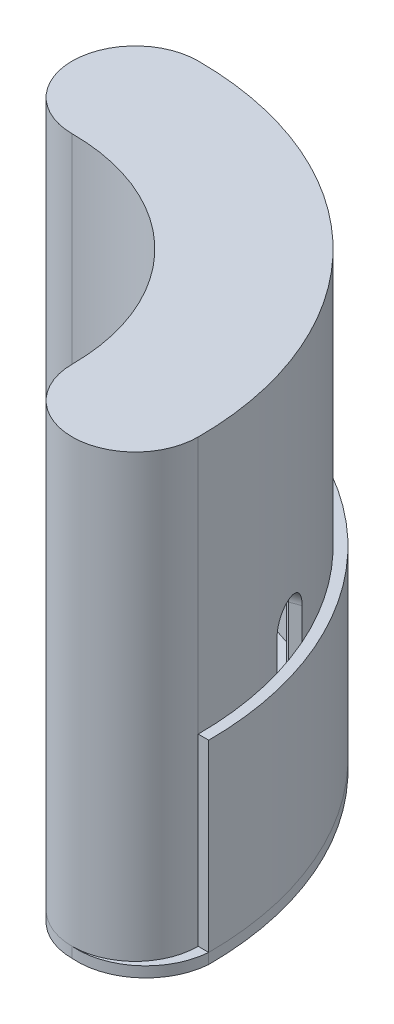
ISO-10303-21;
HEADER;
FILE_DESCRIPTION(('STEP AP214'),'2;1');
FILE_NAME('part.step','',(''),(''),'','','');
FILE_SCHEMA(('AUTOMOTIVE_DESIGN { 1 0 10303 214 1 1 1 1 }'));
ENDSEC;
DATA;
#1=APPLICATION_CONTEXT('core data for automotive mechanical design processes');
#2=APPLICATION_PROTOCOL_DEFINITION('international standard','automotive_design',2000,#1);
#3=PRODUCT_CONTEXT('',#1,'mechanical');
#4=PRODUCT('Part','Part','',(#3));
#5=PRODUCT_RELATED_PRODUCT_CATEGORY('part','',(#4));
#6=PRODUCT_DEFINITION_FORMATION('','',#4);
#7=PRODUCT_DEFINITION_CONTEXT('part definition',#1,'design');
#8=PRODUCT_DEFINITION('design','',#6,#7);
#9=PRODUCT_DEFINITION_SHAPE('','',#8);
#10=(LENGTH_UNIT() NAMED_UNIT(*) SI_UNIT(.MILLI.,.METRE.));
#11=(NAMED_UNIT(*) PLANE_ANGLE_UNIT() SI_UNIT($,.RADIAN.));
#12=(NAMED_UNIT(*) SI_UNIT($,.STERADIAN.) SOLID_ANGLE_UNIT());
#13=UNCERTAINTY_MEASURE_WITH_UNIT(LENGTH_MEASURE(1.E-05),#10,'distance_accuracy_value','');
#14=(GEOMETRIC_REPRESENTATION_CONTEXT(3) GLOBAL_UNCERTAINTY_ASSIGNED_CONTEXT((#13)) GLOBAL_UNIT_ASSIGNED_CONTEXT((#10,
#11,#12)) REPRESENTATION_CONTEXT('',''));
#15=CARTESIAN_POINT('',(0.,0.,0.));
#16=DIRECTION('',(0.,0.,1.));
#17=DIRECTION('',(1.,0.,0.));
#18=AXIS2_PLACEMENT_3D('',#15,#16,#17);
#19=CARTESIAN_POINT('',(-1.73472347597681E-13,44.45,1.80411241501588E-13));
#20=DIRECTION('',(0.,-1.,0.));
#21=DIRECTION('',(0.,0.,-1.));
#22=AXIS2_PLACEMENT_3D('',#19,#20,#21);
#23=CYLINDRICAL_SURFACE('',#22,81.2800000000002);
#24=CARTESIAN_POINT('',(-1.73472347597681E-13,0.,1.80411241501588E-13));
#25=DIRECTION('',(0.,1.,0.));
#26=DIRECTION('',(0.,0.,-1.));
#27=AXIS2_PLACEMENT_3D('',#24,#25,#26);
#28=CIRCLE('',#27,81.2800000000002);
#29=CARTESIAN_POINT('',(81.28,0.,0.));
#30=VERTEX_POINT('',#29);
#31=CARTESIAN_POINT('',(0.,0.,-81.28));
#32=VERTEX_POINT('',#31);
#33=EDGE_CURVE('E105',#30,#32,#28,.T.);
#34=ORIENTED_EDGE('',*,*,#33,.T.);
#35=DIRECTION('',(0.,-1.,0.));
#36=VECTOR('',#35,1.);
#37=CARTESIAN_POINT('',(0.,44.45,-81.28));
#38=LINE('',#37,#36);
#39=CARTESIAN_POINT('',(0.,44.45,-81.28));
#40=VERTEX_POINT('',#39);
#41=EDGE_CURVE('E12',#40,#32,#38,.T.);
#42=ORIENTED_EDGE('',*,*,#41,.F.);
#43=CARTESIAN_POINT('',(-1.73472347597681E-13,44.45,1.80411241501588E-13));
#44=DIRECTION('',(0.,1.,0.));
#45=DIRECTION('',(0.,0.,-1.));
#46=AXIS2_PLACEMENT_3D('',#43,#44,#45);
#47=CIRCLE('',#46,81.2800000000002);
#48=CARTESIAN_POINT('',(81.28,44.45,0.));
#49=VERTEX_POINT('',#48);
#50=EDGE_CURVE('E93',#49,#40,#47,.T.);
#51=ORIENTED_EDGE('',*,*,#50,.F.);
#52=DIRECTION('',(0.,-1.,0.));
#53=VECTOR('',#52,1.);
#54=CARTESIAN_POINT('',(81.28,44.45,0.));
#55=LINE('',#54,#53);
#56=EDGE_CURVE('E101',#49,#30,#55,.T.);
#57=ORIENTED_EDGE('',*,*,#56,.T.);
#58=EDGE_LOOP('',(#34,#42,#51,#57));
#59=FACE_BOUND('',#58,.T.);
#60=ADVANCED_FACE('F42',(#59),#23,.T.);
#61=CARTESIAN_POINT('',(0.,44.45,-81.28));
#62=DIRECTION('',(1.,0.,0.));
#63=DIRECTION('',(0.,0.,-1.));
#64=AXIS2_PLACEMENT_3D('',#61,#62,#63);
#65=PLANE('',#64);
#66=DIRECTION('',(0.,0.,1.));
#67=VECTOR('',#66,1.);
#68=CARTESIAN_POINT('',(0.,0.,-81.28));
#69=LINE('',#68,#67);
#70=CARTESIAN_POINT('',(0.,0.,-78.74));
#71=VERTEX_POINT('',#70);
#72=EDGE_CURVE('E97',#32,#71,#69,.T.);
#73=ORIENTED_EDGE('',*,*,#72,.T.);
#74=DIRECTION('',(0.,-1.,0.));
#75=VECTOR('',#74,1.);
#76=CARTESIAN_POINT('',(0.,44.45,-78.74));
#77=LINE('',#76,#75);
#78=CARTESIAN_POINT('',(0.,44.45,-78.74));
#79=VERTEX_POINT('',#78);
#80=EDGE_CURVE('E50',#79,#71,#77,.T.);
#81=ORIENTED_EDGE('',*,*,#80,.F.);
#82=DIRECTION('',(0.,0.,1.));
#83=VECTOR('',#82,1.);
#84=CARTESIAN_POINT('',(0.,44.45,-81.28));
#85=LINE('',#84,#83);
#86=EDGE_CURVE('E88',#40,#79,#85,.T.);
#87=ORIENTED_EDGE('',*,*,#86,.F.);
#88=ORIENTED_EDGE('',*,*,#41,.T.);
#89=EDGE_LOOP('',(#73,#81,#87,#88));
#90=FACE_BOUND('',#89,.T.);
#91=ADVANCED_FACE('F96',(#90),#65,.F.);
#92=CARTESIAN_POINT('',(-1.59594559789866E-13,44.45,1.66533453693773E-13));
#93=DIRECTION('',(0.,-1.,0.));
#94=DIRECTION('',(0.,0.,-1.));
#95=AXIS2_PLACEMENT_3D('',#92,#93,#94);
#96=CYLINDRICAL_SURFACE('',#95,78.7400000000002);
#97=CARTESIAN_POINT('',(-1.59594559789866E-13,0.,1.66533453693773E-13));
#98=DIRECTION('',(0.,-1.,0.));
#99=DIRECTION('',(0.,0.,-1.));
#100=AXIS2_PLACEMENT_3D('',#97,#98,#99);
#101=CIRCLE('',#100,78.7400000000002);
#102=CARTESIAN_POINT('',(78.74,0.,0.));
#103=VERTEX_POINT('',#102);
#104=EDGE_CURVE('E75',#71,#103,#101,.T.);
#105=ORIENTED_EDGE('',*,*,#104,.T.);
#106=DIRECTION('',(0.,-1.,0.));
#107=VECTOR('',#106,1.);
#108=CARTESIAN_POINT('',(78.74,44.45,0.));
#109=LINE('',#108,#107);
#110=CARTESIAN_POINT('',(78.74,44.45,0.));
#111=VERTEX_POINT('',#110);
#112=EDGE_CURVE('E98',#111,#103,#109,.T.);
#113=ORIENTED_EDGE('',*,*,#112,.F.);
#114=CARTESIAN_POINT('',(-1.59594559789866E-13,44.45,1.66533453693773E-13));
#115=DIRECTION('',(0.,-1.,0.));
#116=DIRECTION('',(0.,0.,-1.));
#117=AXIS2_PLACEMENT_3D('',#114,#115,#116);
#118=CIRCLE('',#117,78.7400000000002);
#119=EDGE_CURVE('E91',#79,#111,#118,.T.);
#120=ORIENTED_EDGE('',*,*,#119,.F.);
#121=ORIENTED_EDGE('',*,*,#80,.T.);
#122=EDGE_LOOP('',(#105,#113,#120,#121));
#123=FACE_BOUND('',#122,.T.);
#124=ADVANCED_FACE('F99',(#123),#96,.F.);
#125=CARTESIAN_POINT('',(78.74,44.45,0.));
#126=DIRECTION('',(0.,0.,-1.));
#127=DIRECTION('',(-1.,0.,0.));
#128=AXIS2_PLACEMENT_3D('',#125,#126,#127);
#129=PLANE('',#128);
#130=DIRECTION('',(1.,0.,0.));
#131=VECTOR('',#130,1.);
#132=CARTESIAN_POINT('',(78.74,0.,0.));
#133=LINE('',#132,#131);
#134=EDGE_CURVE('E81',#103,#30,#133,.T.);
#135=ORIENTED_EDGE('',*,*,#134,.T.);
#136=ORIENTED_EDGE('',*,*,#56,.F.);
#137=DIRECTION('',(1.,0.,0.));
#138=VECTOR('',#137,1.);
#139=CARTESIAN_POINT('',(78.74,44.45,0.));
#140=LINE('',#139,#138);
#141=EDGE_CURVE('E58',#111,#49,#140,.T.);
#142=ORIENTED_EDGE('',*,*,#141,.F.);
#143=ORIENTED_EDGE('',*,*,#112,.T.);
#144=EDGE_LOOP('',(#135,#136,#142,#143));
#145=FACE_BOUND('',#144,.T.);
#146=ADVANCED_FACE('F112',(#145),#129,.F.);
#147=CARTESIAN_POINT('',(-1.73472347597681E-13,44.45,1.80411241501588E-13));
#148=DIRECTION('',(0.,-1.,0.));
#149=DIRECTION('',(0.,0.,-1.));
#150=AXIS2_PLACEMENT_3D('',#147,#148,#149);
#151=PLANE('',#150);
#152=ORIENTED_EDGE('',*,*,#50,.T.);
#153=ORIENTED_EDGE('',*,*,#86,.T.);
#154=ORIENTED_EDGE('',*,*,#119,.T.);
#155=ORIENTED_EDGE('',*,*,#141,.T.);
#156=EDGE_LOOP('',(#152,#153,#154,#155));
#157=FACE_BOUND('',#156,.T.);
#158=ADVANCED_FACE('F89',(#157),#151,.F.);
#159=CARTESIAN_POINT('',(-1.73472347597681E-13,0.,1.80411241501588E-13));
#160=DIRECTION('',(0.,-1.,0.));
#161=DIRECTION('',(0.,0.,-1.));
#162=AXIS2_PLACEMENT_3D('',#159,#160,#161);
#163=PLANE('',#162);
#164=ORIENTED_EDGE('',*,*,#33,.F.);
#165=ORIENTED_EDGE('',*,*,#134,.F.);
#166=ORIENTED_EDGE('',*,*,#104,.F.);
#167=ORIENTED_EDGE('',*,*,#72,.F.);
#168=EDGE_LOOP('',(#164,#165,#166,#167));
#169=FACE_BOUND('',#168,.T.);
#170=ADVANCED_FACE('F115',(#169),#163,.T.);
#171=CLOSED_SHELL('',(#60,#91,#124,#146,#158,#170));
#172=MANIFOLD_SOLID_BREP('B2',#171);
#173=CARTESIAN_POINT('',(0.,-2.54,-63.5));
#174=DIRECTION('',(0.,1.,0.));
#175=DIRECTION('',(0.,0.,1.));
#176=AXIS2_PLACEMENT_3D('',#173,#174,#175);
#177=CYLINDRICAL_SURFACE('',#176,15.24);
#178=CARTESIAN_POINT('',(0.,0.,-63.5));
#179=DIRECTION('',(0.,-1.,0.));
#180=DIRECTION('',(0.,0.,-1.));
#181=AXIS2_PLACEMENT_3D('',#178,#179,#180);
#182=CIRCLE('',#181,15.24);
#183=CARTESIAN_POINT('',(0.,0.,-48.26));
#184=VERTEX_POINT('',#183);
#185=CARTESIAN_POINT('',(-15.24,0.,-63.5));
#186=VERTEX_POINT('',#185);
#187=EDGE_CURVE('E259',#184,#186,#182,.T.);
#188=ORIENTED_EDGE('',*,*,#187,.T.);
#189=DIRECTION('',(0.,1.,0.));
#190=VECTOR('',#189,1.);
#191=CARTESIAN_POINT('',(-15.24,-2.54,-63.5));
#192=LINE('',#191,#190);
#193=CARTESIAN_POINT('',(-15.24,-2.54,-63.5));
#194=VERTEX_POINT('',#193);
#195=EDGE_CURVE('E40',#194,#186,#192,.T.);
#196=ORIENTED_EDGE('',*,*,#195,.F.);
#197=CARTESIAN_POINT('',(0.,-2.54,-63.5));
#198=DIRECTION('',(0.,-1.,0.));
#199=DIRECTION('',(0.,0.,-1.));
#200=AXIS2_PLACEMENT_3D('',#197,#198,#199);
#201=CIRCLE('',#200,15.24);
#202=CARTESIAN_POINT('',(0.,-2.54,-48.26));
#203=VERTEX_POINT('',#202);
#204=EDGE_CURVE('E269',#203,#194,#201,.T.);
#205=ORIENTED_EDGE('',*,*,#204,.F.);
#206=DIRECTION('',(0.,1.,0.));
#207=VECTOR('',#206,1.);
#208=CARTESIAN_POINT('',(0.,-2.54,-48.26));
#209=LINE('',#208,#207);
#210=EDGE_CURVE('E255',#203,#184,#209,.T.);
#211=ORIENTED_EDGE('',*,*,#210,.T.);
#212=EDGE_LOOP('',(#188,#196,#205,#211));
#213=FACE_BOUND('',#212,.T.);
#214=ADVANCED_FACE('F175',(#213),#177,.T.);
#215=CARTESIAN_POINT('',(1.27000000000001,-2.54,-64.77));
#216=DIRECTION('',(0.,1.,0.));
#217=DIRECTION('',(0.,0.,1.));
#218=AXIS2_PLACEMENT_3D('',#215,#216,#217);
#219=CYLINDRICAL_SURFACE('',#218,16.5587741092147);
#220=CARTESIAN_POINT('',(1.27000000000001,0.,-64.77));
#221=DIRECTION('',(0.,-1.,0.));
#222=DIRECTION('',(0.,0.,-1.));
#223=AXIS2_PLACEMENT_3D('',#220,#221,#222);
#224=CIRCLE('',#223,16.5587741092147);
#225=CARTESIAN_POINT('',(0.,0.,-81.28));
#226=VERTEX_POINT('',#225);
#227=EDGE_CURVE('E262',#186,#226,#224,.T.);
#228=ORIENTED_EDGE('',*,*,#227,.T.);
#229=DIRECTION('',(0.,1.,0.));
#230=VECTOR('',#229,1.);
#231=CARTESIAN_POINT('',(0.,-2.54,-81.28));
#232=LINE('',#231,#230);
#233=CARTESIAN_POINT('',(0.,-2.54,-81.28));
#234=VERTEX_POINT('',#233);
#235=EDGE_CURVE('E183',#234,#226,#232,.T.);
#236=ORIENTED_EDGE('',*,*,#235,.F.);
#237=CARTESIAN_POINT('',(1.27000000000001,-2.54,-64.77));
#238=DIRECTION('',(0.,-1.,0.));
#239=DIRECTION('',(0.,0.,-1.));
#240=AXIS2_PLACEMENT_3D('',#237,#238,#239);
#241=CIRCLE('',#240,16.5587741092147);
#242=EDGE_CURVE('E228',#194,#234,#241,.T.);
#243=ORIENTED_EDGE('',*,*,#242,.F.);
#244=ORIENTED_EDGE('',*,*,#195,.T.);
#245=EDGE_LOOP('',(#228,#236,#243,#244));
#246=FACE_BOUND('',#245,.T.);
#247=ADVANCED_FACE('F293',(#246),#219,.T.);
#248=CARTESIAN_POINT('',(-1.87350135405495E-13,-2.54,1.94289029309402E-13));
#249=DIRECTION('',(0.,1.,0.));
#250=DIRECTION('',(0.,0.,1.));
#251=AXIS2_PLACEMENT_3D('',#248,#249,#250);
#252=CYLINDRICAL_SURFACE('',#251,81.2800000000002);
#253=CARTESIAN_POINT('',(-1.87350135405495E-13,0.,1.94289029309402E-13));
#254=DIRECTION('',(0.,-1.,0.));
#255=DIRECTION('',(0.,0.,-1.));
#256=AXIS2_PLACEMENT_3D('',#253,#254,#255);
#257=CIRCLE('',#256,81.2800000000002);
#258=CARTESIAN_POINT('',(81.28,0.,0.));
#259=VERTEX_POINT('',#258);
#260=EDGE_CURVE('E264',#226,#259,#257,.T.);
#261=ORIENTED_EDGE('',*,*,#260,.T.);
#262=DIRECTION('',(0.,1.,0.));
#263=VECTOR('',#262,1.);
#264=CARTESIAN_POINT('',(81.28,-2.54,0.));
#265=LINE('',#264,#263);
#266=CARTESIAN_POINT('',(81.28,-2.54,0.));
#267=VERTEX_POINT('',#266);
#268=EDGE_CURVE('E250',#267,#259,#265,.T.);
#269=ORIENTED_EDGE('',*,*,#268,.F.);
#270=CARTESIAN_POINT('',(-1.87350135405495E-13,-2.54,1.94289029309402E-13));
#271=DIRECTION('',(0.,-1.,0.));
#272=DIRECTION('',(0.,0.,-1.));
#273=AXIS2_PLACEMENT_3D('',#270,#271,#272);
#274=CIRCLE('',#273,81.2800000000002);
#275=EDGE_CURVE('E241',#234,#267,#274,.T.);
#276=ORIENTED_EDGE('',*,*,#275,.F.);
#277=ORIENTED_EDGE('',*,*,#235,.T.);
#278=EDGE_LOOP('',(#261,#269,#276,#277));
#279=FACE_BOUND('',#278,.T.);
#280=ADVANCED_FACE('F275',(#279),#252,.T.);
#281=CARTESIAN_POINT('',(64.77,-2.54,-1.27000000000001));
#282=DIRECTION('',(0.,1.,0.));
#283=DIRECTION('',(0.,0.,1.));
#284=AXIS2_PLACEMENT_3D('',#281,#282,#283);
#285=CYLINDRICAL_SURFACE('',#284,16.5587741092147);
#286=CARTESIAN_POINT('',(64.77,0.,-1.27000000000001));
#287=DIRECTION('',(0.,-1.,0.));
#288=DIRECTION('',(0.,0.,1.));
#289=AXIS2_PLACEMENT_3D('',#286,#287,#288);
#290=CIRCLE('',#289,16.5587741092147);
#291=CARTESIAN_POINT('',(63.5,0.,15.24));
#292=VERTEX_POINT('',#291);
#293=EDGE_CURVE('E249',#259,#292,#290,.T.);
#294=ORIENTED_EDGE('',*,*,#293,.T.);
#295=DIRECTION('',(0.,1.,0.));
#296=VECTOR('',#295,1.);
#297=CARTESIAN_POINT('',(63.5,-2.54,15.24));
#298=LINE('',#297,#296);
#299=CARTESIAN_POINT('',(63.5,-2.54,15.24));
#300=VERTEX_POINT('',#299);
#301=EDGE_CURVE('E246',#300,#292,#298,.T.);
#302=ORIENTED_EDGE('',*,*,#301,.F.);
#303=CARTESIAN_POINT('',(64.77,-2.54,-1.27000000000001));
#304=DIRECTION('',(0.,-1.,0.));
#305=DIRECTION('',(0.,0.,1.));
#306=AXIS2_PLACEMENT_3D('',#303,#304,#305);
#307=CIRCLE('',#306,16.5587741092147);
#308=EDGE_CURVE('E235',#267,#300,#307,.T.);
#309=ORIENTED_EDGE('',*,*,#308,.F.);
#310=ORIENTED_EDGE('',*,*,#268,.T.);
#311=EDGE_LOOP('',(#294,#302,#309,#310));
#312=FACE_BOUND('',#311,.T.);
#313=ADVANCED_FACE('F247',(#312),#285,.T.);
#314=CARTESIAN_POINT('',(63.5,-2.54,0.));
#315=DIRECTION('',(0.,1.,0.));
#316=DIRECTION('',(0.,0.,1.));
#317=AXIS2_PLACEMENT_3D('',#314,#315,#316);
#318=CYLINDRICAL_SURFACE('',#317,15.24);
#319=CARTESIAN_POINT('',(63.5,0.,0.));
#320=DIRECTION('',(0.,-1.,0.));
#321=DIRECTION('',(0.,0.,1.));
#322=AXIS2_PLACEMENT_3D('',#319,#320,#321);
#323=CIRCLE('',#322,15.24);
#324=CARTESIAN_POINT('',(48.26,0.,0.));
#325=VERTEX_POINT('',#324);
#326=EDGE_CURVE('E214',#292,#325,#323,.T.);
#327=ORIENTED_EDGE('',*,*,#326,.T.);
#328=DIRECTION('',(0.,1.,0.));
#329=VECTOR('',#328,1.);
#330=CARTESIAN_POINT('',(48.26,-2.54,0.));
#331=LINE('',#330,#329);
#332=CARTESIAN_POINT('',(48.26,-2.54,0.));
#333=VERTEX_POINT('',#332);
#334=EDGE_CURVE('E251',#333,#325,#331,.T.);
#335=ORIENTED_EDGE('',*,*,#334,.F.);
#336=CARTESIAN_POINT('',(63.5,-2.54,0.));
#337=DIRECTION('',(0.,-1.,0.));
#338=DIRECTION('',(0.,0.,1.));
#339=AXIS2_PLACEMENT_3D('',#336,#337,#338);
#340=CIRCLE('',#339,15.24);
#341=EDGE_CURVE('E239',#300,#333,#340,.T.);
#342=ORIENTED_EDGE('',*,*,#341,.F.);
#343=ORIENTED_EDGE('',*,*,#301,.T.);
#344=EDGE_LOOP('',(#327,#335,#342,#343));
#345=FACE_BOUND('',#344,.T.);
#346=ADVANCED_FACE('F253',(#345),#318,.T.);
#347=CARTESIAN_POINT('',(0.,-2.54,0.));
#348=DIRECTION('',(0.,1.,0.));
#349=DIRECTION('',(0.,0.,1.));
#350=AXIS2_PLACEMENT_3D('',#347,#348,#349);
#351=CYLINDRICAL_SURFACE('',#350,48.26);
#352=CARTESIAN_POINT('',(0.,0.,0.));
#353=DIRECTION('',(0.,1.,0.));
#354=DIRECTION('',(0.,0.,-1.));
#355=AXIS2_PLACEMENT_3D('',#352,#353,#354);
#356=CIRCLE('',#355,48.26);
#357=EDGE_CURVE('E220',#325,#184,#356,.T.);
#358=ORIENTED_EDGE('',*,*,#357,.T.);
#359=ORIENTED_EDGE('',*,*,#210,.F.);
#360=CARTESIAN_POINT('',(0.,-2.54,0.));
#361=DIRECTION('',(0.,1.,0.));
#362=DIRECTION('',(0.,0.,-1.));
#363=AXIS2_PLACEMENT_3D('',#360,#361,#362);
#364=CIRCLE('',#363,48.26);
#365=EDGE_CURVE('E191',#333,#203,#364,.T.);
#366=ORIENTED_EDGE('',*,*,#365,.F.);
#367=ORIENTED_EDGE('',*,*,#334,.T.);
#368=EDGE_LOOP('',(#358,#359,#366,#367));
#369=FACE_BOUND('',#368,.T.);
#370=ADVANCED_FACE('F282',(#369),#351,.F.);
#371=CARTESIAN_POINT('',(0.63500000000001,-2.54,-64.135));
#372=DIRECTION('',(0.,-1.,0.));
#373=DIRECTION('',(0.,0.,-1.));
#374=AXIS2_PLACEMENT_3D('',#371,#372,#373);
#375=PLANE('',#374);
#376=ORIENTED_EDGE('',*,*,#204,.T.);
#377=ORIENTED_EDGE('',*,*,#242,.T.);
#378=ORIENTED_EDGE('',*,*,#275,.T.);
#379=ORIENTED_EDGE('',*,*,#308,.T.);
#380=ORIENTED_EDGE('',*,*,#341,.T.);
#381=ORIENTED_EDGE('',*,*,#365,.T.);
#382=EDGE_LOOP('',(#376,#377,#378,#379,#380,#381));
#383=FACE_BOUND('',#382,.T.);
#384=ADVANCED_FACE('F237',(#383),#375,.T.);
#385=CARTESIAN_POINT('',(0.63500000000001,0.,-64.135));
#386=DIRECTION('',(0.,-1.,0.));
#387=DIRECTION('',(0.,0.,-1.));
#388=AXIS2_PLACEMENT_3D('',#385,#386,#387);
#389=PLANE('',#388);
#390=ORIENTED_EDGE('',*,*,#187,.F.);
#391=ORIENTED_EDGE('',*,*,#357,.F.);
#392=ORIENTED_EDGE('',*,*,#326,.F.);
#393=ORIENTED_EDGE('',*,*,#293,.F.);
#394=ORIENTED_EDGE('',*,*,#260,.F.);
#395=ORIENTED_EDGE('',*,*,#227,.F.);
#396=EDGE_LOOP('',(#390,#391,#392,#393,#394,#395));
#397=FACE_BOUND('',#396,.T.);
#398=ADVANCED_FACE('F278',(#397),#389,.F.);
#399=CLOSED_SHELL('',(#214,#247,#280,#313,#346,#370,#384,#398));
#400=MANIFOLD_SOLID_BREP('B6',#399);
#401=CARTESIAN_POINT('',(0.,104.14,0.));
#402=DIRECTION('',(0.,-1.,0.));
#403=DIRECTION('',(0.,0.,-1.));
#404=AXIS2_PLACEMENT_3D('',#401,#402,#403);
#405=CYLINDRICAL_SURFACE('',#404,78.74);
#406=CARTESIAN_POINT('',(31.0029089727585,52.07,-72.3796051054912));
#407=CARTESIAN_POINT('',(31.0029100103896,51.9274355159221,-72.3796045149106));
#408=CARTESIAN_POINT('',(30.9973788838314,51.784889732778,-72.3819745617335));
#409=CARTESIAN_POINT('',(30.9752911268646,51.5007660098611,-72.391429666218));
#410=CARTESIAN_POINT('',(30.95873170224,51.3591883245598,-72.3985159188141));
#411=CARTESIAN_POINT('',(30.9146755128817,51.0779367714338,-72.4173391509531));
#412=CARTESIAN_POINT('',(30.8871694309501,50.9382646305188,-72.4290800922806));
#413=CARTESIAN_POINT('',(30.8213928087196,50.6618871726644,-72.4570950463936));
#414=CARTESIAN_POINT('',(30.7831183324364,50.5251829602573,-72.4733707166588));
#415=CARTESIAN_POINT('',(30.6961048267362,50.255888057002,-72.5102680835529));
#416=CARTESIAN_POINT('',(30.6473752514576,50.123293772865,-72.530885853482));
#417=CARTESIAN_POINT('',(30.5397369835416,49.8629805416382,-72.5762735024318));
#418=CARTESIAN_POINT('',(30.4808245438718,49.7352634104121,-72.6010449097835));
#419=CARTESIAN_POINT('',(30.3532647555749,49.4857343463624,-72.6544678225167));
#420=CARTESIAN_POINT('',(30.2846232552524,49.363918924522,-72.6831169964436));
#421=CARTESIAN_POINT('',(30.1380095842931,49.1269268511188,-72.7440326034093));
#422=CARTESIAN_POINT('',(30.0600339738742,49.0117526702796,-72.7763003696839));
#423=CARTESIAN_POINT('',(29.8952076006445,48.7887884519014,-72.8441631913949));
#424=CARTESIAN_POINT('',(29.8083477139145,48.6810061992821,-72.8797616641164));
#425=CARTESIAN_POINT('',(29.6263687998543,48.473680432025,-72.9539274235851));
#426=CARTESIAN_POINT('',(29.5312467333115,48.3741399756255,-72.9924958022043));
#427=CARTESIAN_POINT('',(29.3334434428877,48.1840777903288,-73.0722112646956));
#428=CARTESIAN_POINT('',(29.2307646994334,48.0935531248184,-73.1133575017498));
#429=CARTESIAN_POINT('',(29.018475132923,47.9220951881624,-73.1978739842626));
#430=CARTESIAN_POINT('',(28.9088617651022,47.8411654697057,-73.2412450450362));
#431=CARTESIAN_POINT('',(28.6834257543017,47.6894741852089,-73.3298258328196));
#432=CARTESIAN_POINT('',(28.56760009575,47.618717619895,-73.3750364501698));
#433=CARTESIAN_POINT('',(28.3305411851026,47.4879006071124,-73.4668918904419));
#434=CARTESIAN_POINT('',(28.2093059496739,47.4278441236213,-73.5135372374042));
#435=CARTESIAN_POINT('',(27.962338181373,47.3189099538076,-73.6078303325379));
#436=CARTESIAN_POINT('',(27.836607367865,47.2700280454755,-73.6554776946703));
#437=CARTESIAN_POINT('',(27.5814795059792,47.1837505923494,-73.7513947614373));
#438=CARTESIAN_POINT('',(27.4520811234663,47.1463592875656,-73.799664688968));
#439=CARTESIAN_POINT('',(27.060192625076,47.052004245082,-73.944645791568));
#440=CARTESIAN_POINT('',(26.7933886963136,47.0125863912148,-74.0417657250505));
#441=CARTESIAN_POINT('',(26.2564362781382,46.9819860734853,-74.2338778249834));
#442=CARTESIAN_POINT('',(25.9862878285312,46.9908030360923,-74.32887001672));
#443=CARTESIAN_POINT('',(25.4505794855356,47.0563049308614,-74.5139970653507));
#444=CARTESIAN_POINT('',(25.1850133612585,47.1129185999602,-74.6041389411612));
#445=CARTESIAN_POINT('',(24.6657304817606,47.2723129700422,-74.777432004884));
#446=CARTESIAN_POINT('',(24.4120138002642,47.3750939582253,-74.8605831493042));
#447=CARTESIAN_POINT('',(23.9235768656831,47.6239815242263,-75.0181047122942));
#448=CARTESIAN_POINT('',(23.6888709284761,47.7701203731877,-75.0924685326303));
#449=CARTESIAN_POINT('',(23.2455130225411,48.1015530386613,-75.2308962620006));
#450=CARTESIAN_POINT('',(23.036861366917,48.2868473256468,-75.2949600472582));
#451=CARTESIAN_POINT('',(22.6513937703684,48.6917332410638,-75.4118206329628));
#452=CARTESIAN_POINT('',(22.4746365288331,48.9113867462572,-75.4645966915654));
#453=CARTESIAN_POINT('',(22.1586930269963,49.3785393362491,-75.557972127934));
#454=CARTESIAN_POINT('',(22.0195067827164,49.6260384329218,-75.5985715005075));
#455=CARTESIAN_POINT('',(21.782890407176,50.1418965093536,-75.6670901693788));
#456=CARTESIAN_POINT('',(21.6854628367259,50.4102567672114,-75.6950086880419));
#457=CARTESIAN_POINT('',(21.5353457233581,50.9602010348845,-75.737854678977));
#458=CARTESIAN_POINT('',(21.4826556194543,51.2417848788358,-75.7527823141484));
#459=CARTESIAN_POINT('',(21.4236831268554,51.8096399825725,-75.7694817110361));
#460=CARTESIAN_POINT('',(21.4173172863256,52.0959018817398,-75.7712771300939));
#461=CARTESIAN_POINT('',(21.4509680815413,52.6654646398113,-75.7617572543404));
#462=CARTESIAN_POINT('',(21.4909844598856,52.9487655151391,-75.7504420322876));
#463=CARTESIAN_POINT('',(21.616118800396,53.5041192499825,-75.714828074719));
#464=CARTESIAN_POINT('',(21.701198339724,53.7761814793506,-75.6905403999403));
#465=CARTESIAN_POINT('',(21.9138508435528,54.3016243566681,-75.6292464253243));
#466=CARTESIAN_POINT('',(22.0414242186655,54.5550048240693,-75.5922400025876));
#467=CARTESIAN_POINT('',(22.3354398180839,55.0362891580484,-75.5058881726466));
#468=CARTESIAN_POINT('',(22.5019373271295,55.2641561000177,-75.4565252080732));
#469=CARTESIAN_POINT('',(22.8687407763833,55.687572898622,-75.3461669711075));
#470=CARTESIAN_POINT('',(23.069047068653,55.8831224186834,-75.2851715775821));
#471=CARTESIAN_POINT('',(23.497873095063,56.236646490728,-75.1524312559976));
#472=CARTESIAN_POINT('',(23.7264341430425,56.3945650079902,-75.0806705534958));
#473=CARTESIAN_POINT('',(24.2048384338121,56.6679593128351,-74.9278075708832));
#474=CARTESIAN_POINT('',(24.4546815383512,56.7834353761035,-74.846705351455));
#475=CARTESIAN_POINT('',(24.9681187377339,56.968575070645,-74.676995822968));
#476=CARTESIAN_POINT('',(25.2317020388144,57.0382740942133,-74.5883943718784));
#477=CARTESIAN_POINT('',(25.7653604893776,57.1299761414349,-74.4057330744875));
#478=CARTESIAN_POINT('',(26.0354355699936,57.1519796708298,-74.3116732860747));
#479=CARTESIAN_POINT('',(26.438993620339,57.1487971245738,-74.1686441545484));
#480=CARTESIAN_POINT('',(26.5732042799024,57.1417143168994,-74.1206627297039));
#481=CARTESIAN_POINT('',(26.8403170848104,57.115594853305,-74.0243545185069));
#482=CARTESIAN_POINT('',(26.9732196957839,57.0965626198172,-73.9760278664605));
#483=CARTESIAN_POINT('',(27.2368322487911,57.0466665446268,-73.8793767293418));
#484=CARTESIAN_POINT('',(27.3675413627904,57.0157983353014,-73.8310522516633));
#485=CARTESIAN_POINT('',(27.6257671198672,56.9424685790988,-73.7348192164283));
#486=CARTESIAN_POINT('',(27.7532849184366,56.900011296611,-73.6869105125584));
#487=CARTESIAN_POINT('',(28.0043342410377,56.803784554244,-73.5918670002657));
#488=CARTESIAN_POINT('',(28.1278643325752,56.7500110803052,-73.5447324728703));
#489=CARTESIAN_POINT('',(28.3699957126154,56.6315669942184,-73.4516695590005));
#490=CARTESIAN_POINT('',(28.4885987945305,56.5669003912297,-73.4057407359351));
#491=CARTESIAN_POINT('',(28.7201527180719,56.4270922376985,-73.3154545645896));
#492=CARTESIAN_POINT('',(28.833101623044,56.3519471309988,-73.2710977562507));
#493=CARTESIAN_POINT('',(29.0524962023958,56.1917611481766,-73.1843834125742));
#494=CARTESIAN_POINT('',(29.158944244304,56.1067239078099,-73.142025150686));
#495=CARTESIAN_POINT('',(29.3648769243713,55.9271465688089,-73.059591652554));
#496=CARTESIAN_POINT('',(29.4643466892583,55.8325871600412,-73.0195213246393));
#497=CARTESIAN_POINT('',(29.6553738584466,55.6348188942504,-72.9421484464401));
#498=CARTESIAN_POINT('',(29.7469341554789,55.5316132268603,-72.9048448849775));
#499=CARTESIAN_POINT('',(29.9216223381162,55.3171859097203,-72.83332364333));
#500=CARTESIAN_POINT('',(30.0047450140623,55.2059593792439,-72.7991078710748));
#501=CARTESIAN_POINT('',(30.1619073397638,54.9763758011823,-72.7341335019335));
#502=CARTESIAN_POINT('',(30.2359503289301,54.858021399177,-72.7033736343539));
#503=CARTESIAN_POINT('',(30.3746089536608,54.6147790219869,-72.6455531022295));
#504=CARTESIAN_POINT('',(30.4392086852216,54.489880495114,-72.6184986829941));
#505=CARTESIAN_POINT('',(30.5583777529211,54.2346663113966,-72.5684320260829));
#506=CARTESIAN_POINT('',(30.6129507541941,54.1043526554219,-72.5454183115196));
#507=CARTESIAN_POINT('',(30.711686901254,53.8393030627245,-72.5036741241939));
#508=CARTESIAN_POINT('',(30.7558589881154,53.7045710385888,-72.4849399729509));
#509=CARTESIAN_POINT('',(30.8335461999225,53.4315838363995,-72.4519275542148));
#510=CARTESIAN_POINT('',(30.8670640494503,53.2933295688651,-72.4376481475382));
#511=CARTESIAN_POINT('',(30.9309341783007,52.975959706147,-72.4104029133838));
#512=CARTESIAN_POINT('',(30.9579023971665,52.7960281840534,-72.39886917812));
#513=CARTESIAN_POINT('',(30.9938891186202,52.4340542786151,-72.3834706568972));
#514=CARTESIAN_POINT('',(31.0029076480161,52.2520118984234,-72.3796058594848));
#515=CARTESIAN_POINT('',(31.0029089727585,52.07,-72.3796051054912));
#516=B_SPLINE_CURVE_WITH_KNOTS('',3,(#406,#407,#408,#409,#410,#411,#412,#413,#414,#415,#416,
#417,#418,#419,#420,#421,#422,#423,#424,#425,#426,#427,#428,#429,#430,#431,#432,#433,#434,#435,
#436,#437,#438,#439,#440,#441,#442,#443,#444,#445,#446,#447,#448,#449,#450,#451,#452,#453,#454,
#455,#456,#457,#458,#459,#460,#461,#462,#463,#464,#465,#466,#467,#468,#469,#470,#471,#472,#473,
#474,#475,#476,#477,#478,#479,#480,#481,#482,#483,#484,#485,#486,#487,#488,#489,#490,#491,#492,
#493,#494,#495,#496,#497,#498,#499,#500,#501,#502,#503,#504,#505,#506,#507,#508,#509,#510,#511,
#512,#513,#514,#515),.UNSPECIFIED.,.T.,.F.,(4,2,2,2,2,2,2,2,2,2,2,2,2,2,2,2,2,2,2,2,2,2,2,2,2,2,
2,2,2,2,2,2,2,2,2,2,2,2,2,2,2,2,2,2,2,2,2,2,2,2,2,2,2,2,4),(0.,0.427534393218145,
0.855177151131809,1.28318467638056,1.71134884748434,2.13912746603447,2.56706383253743,
2.99474404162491,3.42258234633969,3.85086452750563,4.27930492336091,4.70760530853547,
5.13606378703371,5.56473216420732,5.99355901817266,6.42222358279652,6.85104613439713,
7.70656376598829,8.56207122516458,9.41630540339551,10.2705448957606,11.1254217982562,
11.9803089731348,12.8367538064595,13.6931990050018,14.5496967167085,15.4061836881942,
16.2611273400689,17.1160662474,17.970277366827,18.8244967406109,19.679936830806,
20.5353858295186,21.3921007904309,22.2488101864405,23.104856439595,23.9608936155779,
24.3885943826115,24.8161369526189,25.2438374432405,25.6713807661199,26.0990760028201,
26.5266141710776,26.9542977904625,27.3818247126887,27.8102367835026,28.2384915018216,
28.667009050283,29.0953685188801,29.524441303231,29.9533569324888,30.3819024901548,
30.8103383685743,31.3561718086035,31.9020044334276),.UNSPECIFIED.);
#517=CARTESIAN_POINT('',(21.4249732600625,52.07,-75.7691105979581));
#518=VERTEX_POINT('',#517);
#519=CARTESIAN_POINT('',(31.0029089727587,52.07,-72.3796051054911));
#520=VERTEX_POINT('',#519);
#521=EDGE_CURVE('E472',#518,#520,#516,.T.);
#522=ORIENTED_EDGE('',*,*,#521,.F.);
#523=DIRECTION('',(0.,-1.,0.));
#524=VECTOR('',#523,1.);
#525=CARTESIAN_POINT('',(21.4249732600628,52.07,-75.769110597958));
#526=LINE('',#525,#524);
#527=CARTESIAN_POINT('',(21.4249732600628,0.,-75.769110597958));
#528=VERTEX_POINT('',#527);
#529=EDGE_CURVE('E493',#518,#528,#526,.T.);
#530=ORIENTED_EDGE('',*,*,#529,.T.);
#531=CARTESIAN_POINT('',(0.,0.,0.));
#532=DIRECTION('',(0.,1.,0.));
#533=DIRECTION('',(0.,0.,-1.));
#534=AXIS2_PLACEMENT_3D('',#531,#532,#533);
#535=CIRCLE('',#534,78.74);
#536=CARTESIAN_POINT('',(0.,0.,-78.74));
#537=VERTEX_POINT('',#536);
#538=EDGE_CURVE('E374',#528,#537,#535,.T.);
#539=ORIENTED_EDGE('',*,*,#538,.T.);
#540=DIRECTION('',(0.,-1.,0.));
#541=VECTOR('',#540,1.);
#542=CARTESIAN_POINT('',(0.,104.14,-78.74));
#543=LINE('',#542,#541);
#544=CARTESIAN_POINT('',(0.,106.68,-78.74));
#545=VERTEX_POINT('',#544);
#546=EDGE_CURVE('E555',#545,#537,#543,.T.);
#547=ORIENTED_EDGE('',*,*,#546,.F.);
#548=CARTESIAN_POINT('',(0.,106.68,0.));
#549=DIRECTION('',(0.,1.,0.));
#550=DIRECTION('',(0.,0.,-1.));
#551=AXIS2_PLACEMENT_3D('',#548,#549,#550);
#552=CIRCLE('',#551,78.74);
#553=CARTESIAN_POINT('',(78.74,106.68,0.));
#554=VERTEX_POINT('',#553);
#555=EDGE_CURVE('E505',#554,#545,#552,.T.);
#556=ORIENTED_EDGE('',*,*,#555,.F.);
#557=DIRECTION('',(0.,-1.,0.));
#558=VECTOR('',#557,1.);
#559=CARTESIAN_POINT('',(78.74,104.14,0.));
#560=LINE('',#559,#558);
#561=CARTESIAN_POINT('',(78.74,0.,0.));
#562=VERTEX_POINT('',#561);
#563=EDGE_CURVE('E558',#554,#562,#560,.T.);
#564=ORIENTED_EDGE('',*,*,#563,.T.);
#565=CARTESIAN_POINT('',(75.5156344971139,0.,-22.3019404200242));
#566=VERTEX_POINT('',#565);
#567=EDGE_CURVE('E552',#562,#566,#535,.T.);
#568=ORIENTED_EDGE('',*,*,#567,.T.);
#569=DIRECTION('',(0.,-1.,0.));
#570=VECTOR('',#569,1.);
#571=CARTESIAN_POINT('',(75.5156344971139,52.07,-22.3019404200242));
#572=LINE('',#571,#570);
#573=CARTESIAN_POINT('',(75.5156344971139,52.07,-22.3019404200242));
#574=VERTEX_POINT('',#573);
#575=EDGE_CURVE('E574',#574,#566,#572,.T.);
#576=ORIENTED_EDGE('',*,*,#575,.F.);
#577=CARTESIAN_POINT('',(75.515634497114,52.07,-22.3019404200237));
#578=CARTESIAN_POINT('',(75.5156347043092,51.9274355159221,-22.3019392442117));
#579=CARTESIAN_POINT('',(75.5139310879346,51.784889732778,-22.3077105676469));
#580=CARTESIAN_POINT('',(75.5071207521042,51.5007660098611,-22.330751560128));
#581=CARTESIAN_POINT('',(75.5020131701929,51.3591883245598,-22.348024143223));
#582=CARTESIAN_POINT('',(75.4884016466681,51.0779367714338,-22.3939587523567));
#583=CARTESIAN_POINT('',(75.4798948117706,50.9382646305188,-22.4226304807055));
#584=CARTESIAN_POINT('',(75.4595044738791,50.6618871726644,-22.4911551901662));
#585=CARTESIAN_POINT('',(75.4476197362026,50.5251829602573,-22.5310122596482));
#586=CARTESIAN_POINT('',(75.4205208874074,50.255888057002,-22.6215573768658));
#587=CARTESIAN_POINT('',(75.4053097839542,50.123293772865,-22.6722356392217));
#588=CARTESIAN_POINT('',(75.3715909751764,49.8629805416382,-22.7840796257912));
#589=CARTESIAN_POINT('',(75.3530820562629,49.7352634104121,-22.8452492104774));
#590=CARTESIAN_POINT('',(75.3128415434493,49.4857343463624,-22.977560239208));
#591=CARTESIAN_POINT('',(75.2911118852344,49.363918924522,-23.0486956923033));
#592=CARTESIAN_POINT('',(75.2444853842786,49.1269268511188,-23.2004594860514));
#593=CARTESIAN_POINT('',(75.2195873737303,49.0117526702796,-23.2810913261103));
#594=CARTESIAN_POINT('',(75.1666914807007,48.7887884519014,-23.4513121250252));
#595=CARTESIAN_POINT('',(75.138690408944,48.6810061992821,-23.5409102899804));
#596=CARTESIAN_POINT('',(75.0797053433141,48.473680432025,-23.72836067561));
#597=CARTESIAN_POINT('',(75.0487202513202,48.3741399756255,-23.8262159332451));
#598=CARTESIAN_POINT('',(74.9839133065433,48.1840777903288,-24.0293925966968));
#599=CARTESIAN_POINT('',(74.9500923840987,48.0935531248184,-24.1347115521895));
#600=CARTESIAN_POINT('',(74.8797406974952,47.9220951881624,-24.3521064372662));
#601=CARTESIAN_POINT('',(74.8432089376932,47.8411654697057,-24.4641848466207));
#602=CARTESIAN_POINT('',(74.7675999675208,47.6894741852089,-24.6942961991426));
#603=CARTESIAN_POINT('',(74.72852151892,47.618717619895,-24.8123320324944));
#604=CARTESIAN_POINT('',(74.6480191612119,47.4879006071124,-25.0534828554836));
#605=CARTESIAN_POINT('',(74.6065943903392,47.4278441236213,-25.17659970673));
#606=CARTESIAN_POINT('',(74.5216476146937,47.3189099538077,-25.4269361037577));
#607=CARTESIAN_POINT('',(74.4781264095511,47.2700280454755,-25.5541540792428));
#608=CARTESIAN_POINT('',(74.3892242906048,47.1837505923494,-25.8118102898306));
#609=CARTESIAN_POINT('',(74.3438426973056,47.1463592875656,-25.9422496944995));
#610=CARTESIAN_POINT('',(74.2054735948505,47.052004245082,-26.3365213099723));
#611=CARTESIAN_POINT('',(74.1100487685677,47.0125863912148,-26.6039361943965));
#612=CARTESIAN_POINT('',(73.9154268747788,46.9819860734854,-27.1399840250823));
#613=CARTESIAN_POINT('',(73.8162298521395,46.9908030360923,-27.4086169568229));
#614=CARTESIAN_POINT('',(73.6170227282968,47.0563049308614,-27.939250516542));
#615=CARTESIAN_POINT('',(73.5170140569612,47.1129185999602,-28.2012604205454));
#616=CARTESIAN_POINT('',(73.3191730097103,47.2723129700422,-28.7116956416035));
#617=CARTESIAN_POINT('',(73.2213406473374,47.3750939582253,-28.9601208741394));
#618=CARTESIAN_POINT('',(73.0310333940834,47.6239815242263,-29.4367410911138));
#619=CARTESIAN_POINT('',(72.9385625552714,47.7701203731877,-29.6649208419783));
#620=CARTESIAN_POINT('',(72.7623109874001,48.1015530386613,-30.094646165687));
#621=CARTESIAN_POINT('',(72.6785303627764,48.2868473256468,-30.2961914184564));
#622=CARTESIAN_POINT('',(72.5226031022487,48.6917332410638,-30.667578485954));
#623=CARTESIAN_POINT('',(72.4504779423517,48.9113867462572,-30.8373618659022));
#624=CARTESIAN_POINT('',(72.3208200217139,49.3785393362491,-31.140228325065));
#625=CARTESIAN_POINT('',(72.2632872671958,49.6260384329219,-31.2733113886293));
#626=CARTESIAN_POINT('',(72.1650965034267,50.1418965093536,-31.4992332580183));
#627=CARTESIAN_POINT('',(72.1244395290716,50.4102567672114,-31.5920695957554));
#628=CARTESIAN_POINT('',(72.0616632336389,50.9602010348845,-31.7350033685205));
#629=CARTESIAN_POINT('',(72.0395436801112,51.2417848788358,-31.7851013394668));
#630=CARTESIAN_POINT('',(72.0147805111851,51.8096399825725,-31.8411674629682));
#631=CARTESIAN_POINT('',(72.0121018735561,52.0959018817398,-31.8472149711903));
#632=CARTESIAN_POINT('',(72.0262392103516,52.6654646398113,-31.8152284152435));
#633=CARTESIAN_POINT('',(72.0430550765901,52.9487655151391,-31.7771945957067));
#634=CARTESIAN_POINT('',(72.0954622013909,53.5041192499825,-31.6581128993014));
#635=CARTESIAN_POINT('',(72.1310374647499,53.7761814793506,-31.5771016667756));
#636=CARTESIAN_POINT('',(72.21950343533,54.3016243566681,-31.3742425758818));
#637=CARTESIAN_POINT('',(72.2723943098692,54.5550048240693,-31.2523943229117));
#638=CARTESIAN_POINT('',(72.3934714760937,55.0362891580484,-30.9708945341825));
#639=CARTESIAN_POINT('',(72.4616795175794,55.2641561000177,-30.8111892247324));
#640=CARTESIAN_POINT('',(72.6107068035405,55.687572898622,-30.4583229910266));
#641=CARTESIAN_POINT('',(72.6915261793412,55.8831224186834,-30.2651617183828));
#642=CARTESIAN_POINT('',(72.8628864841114,56.236646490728,-29.8502552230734));
#643=CARTESIAN_POINT('',(72.9534416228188,56.3945650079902,-29.6284681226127));
#644=CARTESIAN_POINT('',(73.140935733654,56.6679593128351,-29.1625456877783));
#645=CARTESIAN_POINT('',(73.237874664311,56.7834353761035,-28.9184104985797));
#646=CARTESIAN_POINT('',(73.4347458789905,56.968575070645,-28.4147629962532));
#647=CARTESIAN_POINT('',(73.5346757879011,57.0382740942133,-28.1552627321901));
#648=CARTESIAN_POINT('',(73.7344739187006,57.1299761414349,-27.6277807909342));
#649=CARTESIAN_POINT('',(73.8343421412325,57.1519796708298,-27.3597992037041));
#650=CARTESIAN_POINT('',(73.9816592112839,57.1487971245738,-26.9577866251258));
#651=CARTESIAN_POINT('',(74.030333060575,57.1417143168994,-26.8238255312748));
#652=CARTESIAN_POINT('',(74.1265800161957,57.115594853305,-26.5566906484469));
#653=CARTESIAN_POINT('',(74.1741535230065,57.0965626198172,-26.4235165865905));
#654=CARTESIAN_POINT('',(74.2679033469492,57.0466665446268,-26.1588583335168));
#655=CARTESIAN_POINT('',(74.3140791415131,57.0157983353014,-26.0273747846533));
#656=CARTESIAN_POINT('',(74.4047143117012,56.9424685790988,-25.767131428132));
#657=CARTESIAN_POINT('',(74.449174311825,56.900011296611,-25.6383706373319));
#658=CARTESIAN_POINT('',(74.5361471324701,56.803784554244,-25.3844124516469));
#659=CARTESIAN_POINT('',(74.5786592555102,56.7500110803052,-25.2592163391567));
#660=CARTESIAN_POINT('',(74.6614678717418,56.6315669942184,-25.0133890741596));
#661=CARTESIAN_POINT('',(74.701765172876,56.5669003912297,-24.8927562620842));
#662=CARTESIAN_POINT('',(74.7799639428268,56.4270922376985,-24.656845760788));
#663=CARTESIAN_POINT('',(74.8178645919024,56.3519471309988,-24.5415699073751));
#664=CARTESIAN_POINT('',(74.89105658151,56.1917611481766,-24.3173015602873));
#665=CARTESIAN_POINT('',(74.9263488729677,56.1067239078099,-24.2083067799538));
#666=CARTESIAN_POINT('',(74.9942490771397,55.9271465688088,-23.9971359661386));
#667=CARTESIAN_POINT('',(75.0268512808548,55.8325871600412,-23.8949745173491));
#668=CARTESIAN_POINT('',(75.0891391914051,55.6348188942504,-23.6985103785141));
#669=CARTESIAN_POINT('',(75.1188259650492,55.5316132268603,-23.6042048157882));
#670=CARTESIAN_POINT('',(75.1751961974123,55.3171859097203,-23.4240558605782));
#671=CARTESIAN_POINT('',(75.2018778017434,55.2059593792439,-23.3382176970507));
#672=CARTESIAN_POINT('',(75.2521085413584,54.9763758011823,-23.1757414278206));
#673=CARTESIAN_POINT('',(75.2756588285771,54.858021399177,-23.0990999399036));
#674=CARTESIAN_POINT('',(75.3195936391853,54.6147790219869,-22.955436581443));
#675=CARTESIAN_POINT('',(75.339972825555,54.489880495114,-22.8884309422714));
#676=CARTESIAN_POINT('',(75.3774448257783,54.2346663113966,-22.7647224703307));
#677=CARTESIAN_POINT('',(75.3945388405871,54.1043526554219,-22.7080158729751));
#678=CARTESIAN_POINT('',(75.4253840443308,53.8393030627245,-22.6053514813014));
#679=CARTESIAN_POINT('',(75.4391381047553,53.7045710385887,-22.5593844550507));
#680=CARTESIAN_POINT('',(75.4632786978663,53.4315838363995,-22.4784996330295));
#681=CARTESIAN_POINT('',(75.4736660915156,53.2933295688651,-22.4435790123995));
#682=CARTESIAN_POINT('',(75.4934328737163,52.975959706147,-22.3770134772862));
#683=CARTESIAN_POINT('',(75.5017561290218,52.7960281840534,-22.3488881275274));
#684=CARTESIAN_POINT('',(75.5128568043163,52.4340542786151,-22.3113523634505));
#685=CARTESIAN_POINT('',(75.5156342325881,52.2520118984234,-22.3019419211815));
#686=CARTESIAN_POINT('',(75.515634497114,52.07,-22.3019404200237));
#687=B_SPLINE_CURVE_WITH_KNOTS('',3,(#577,#578,#579,#580,#581,#582,#583,#584,#585,#586,#587,
#588,#589,#590,#591,#592,#593,#594,#595,#596,#597,#598,#599,#600,#601,#602,#603,#604,#605,#606,
#607,#608,#609,#610,#611,#612,#613,#614,#615,#616,#617,#618,#619,#620,#621,#622,#623,#624,#625,
#626,#627,#628,#629,#630,#631,#632,#633,#634,#635,#636,#637,#638,#639,#640,#641,#642,#643,#644,
#645,#646,#647,#648,#649,#650,#651,#652,#653,#654,#655,#656,#657,#658,#659,#660,#661,#662,#663,
#664,#665,#666,#667,#668,#669,#670,#671,#672,#673,#674,#675,#676,#677,#678,#679,#680,#681,#682,
#683,#684,#685,#686),.UNSPECIFIED.,.T.,.F.,(4,2,2,2,2,2,2,2,2,2,2,2,2,2,2,2,2,2,2,2,2,2,2,2,2,2,
2,2,2,2,2,2,2,2,2,2,2,2,2,2,2,2,2,2,2,2,2,2,2,2,2,2,2,2,4),(0.,0.427534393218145,
0.855177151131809,1.28318467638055,1.71134884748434,2.13912746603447,2.56706383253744,
2.99474404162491,3.42258234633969,3.85086452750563,4.27930492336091,4.70760530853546,
5.1360637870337,5.56473216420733,5.99355901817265,6.42222358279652,6.85104613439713,
7.70656376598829,8.56207122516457,9.4163054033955,10.2705448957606,11.1254217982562,
11.9803089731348,12.8367538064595,13.6931990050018,14.5496967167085,15.4061836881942,
16.2611273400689,17.1160662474,17.970277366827,18.8244967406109,19.6799368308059,
20.5353858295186,21.3921007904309,22.2488101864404,23.104856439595,23.9608936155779,
24.3885943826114,24.8161369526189,25.2438374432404,25.6713807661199,26.09907600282,
26.5266141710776,26.9542977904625,27.3818247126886,27.8102367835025,28.2384915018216,
28.667009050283,29.0953685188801,29.524441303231,29.9533569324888,30.3819024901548,
30.8103383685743,31.3561718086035,31.9020044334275),.UNSPECIFIED.);
#688=CARTESIAN_POINT('',(72.0153177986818,52.07,-31.8399372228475));
#689=VERTEX_POINT('',#688);
#690=EDGE_CURVE('E604',#689,#574,#687,.T.);
#691=ORIENTED_EDGE('',*,*,#690,.F.);
#692=DIRECTION('',(0.,-1.,0.));
#693=VECTOR('',#692,1.);
#694=CARTESIAN_POINT('',(72.0153177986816,52.07,-31.8399372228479));
#695=LINE('',#694,#693);
#696=CARTESIAN_POINT('',(72.0153177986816,0.,-31.8399372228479));
#697=VERTEX_POINT('',#696);
#698=EDGE_CURVE('E585',#689,#697,#695,.T.);
#699=ORIENTED_EDGE('',*,*,#698,.T.);
#700=CARTESIAN_POINT('',(31.0029089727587,0.,-72.3796051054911));
#701=VERTEX_POINT('',#700);
#702=EDGE_CURVE('E556',#697,#701,#535,.T.);
#703=ORIENTED_EDGE('',*,*,#702,.T.);
#704=DIRECTION('',(0.,-1.,0.));
#705=VECTOR('',#704,1.);
#706=CARTESIAN_POINT('',(31.0029089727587,52.07,-72.3796051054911));
#707=LINE('',#706,#705);
#708=EDGE_CURVE('E477',#520,#701,#707,.T.);
#709=ORIENTED_EDGE('',*,*,#708,.F.);
#710=EDGE_LOOP('',(#522,#530,#539,#547,#556,#564,#568,#576,#691,#699,#703,#709));
#711=FACE_BOUND('',#710,.T.);
#712=ADVANCED_FACE('F351',(#711),#405,.T.);
#713=CARTESIAN_POINT('',(0.,104.14,0.));
#714=DIRECTION('',(0.,-1.,0.));
#715=DIRECTION('',(0.,0.,-1.));
#716=AXIS2_PLACEMENT_3D('',#713,#714,#715);
#717=CYLINDRICAL_SURFACE('',#716,76.2);
#718=DIRECTION('',(0.,-1.,0.));
#719=VECTOR('',#718,1.);
#720=CARTESIAN_POINT('',(20.5757686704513,52.07,-73.369460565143));
#721=LINE('',#720,#719);
#722=CARTESIAN_POINT('',(20.575768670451,52.07,-73.3694605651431));
#723=VERTEX_POINT('',#722);
#724=CARTESIAN_POINT('',(20.5757686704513,0.,-73.369460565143));
#725=VERTEX_POINT('',#724);
#726=EDGE_CURVE('E486',#723,#725,#721,.T.);
#727=ORIENTED_EDGE('',*,*,#726,.F.);
#728=CARTESIAN_POINT('',(30.153704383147,52.07,-69.9799550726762));
#729=CARTESIAN_POINT('',(30.1537054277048,51.9274463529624,-69.9799544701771));
#730=CARTESIAN_POINT('',(30.1481794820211,51.7849115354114,-69.9823364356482));
#731=CARTESIAN_POINT('',(30.1261123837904,51.5008098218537,-69.9918388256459));
#732=CARTESIAN_POINT('',(30.1095684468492,51.3592431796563,-69.998960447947));
#733=CARTESIAN_POINT('',(30.0655533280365,51.0780141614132,-70.0178768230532));
#734=CARTESIAN_POINT('',(30.038072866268,50.9383535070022,-70.0296755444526));
#735=CARTESIAN_POINT('',(29.972357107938,50.6619989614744,-70.0578267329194));
#736=CARTESIAN_POINT('',(29.934117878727,50.5253061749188,-70.074180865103));
#737=CARTESIAN_POINT('',(29.8471839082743,50.2560343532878,-70.1112533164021));
#738=CARTESIAN_POINT('',(29.7984986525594,50.1234517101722,-70.1319676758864));
#739=CARTESIAN_POINT('',(29.6909570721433,49.863161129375,-70.1775639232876));
#740=CARTESIAN_POINT('',(29.6320970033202,49.7354550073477,-70.2024473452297));
#741=CARTESIAN_POINT('',(29.5046486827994,49.4859467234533,-70.256106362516));
#742=CARTESIAN_POINT('',(29.436066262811,49.3641410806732,-70.2848796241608));
#743=CARTESIAN_POINT('',(29.2895761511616,49.1271670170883,-70.3460519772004));
#744=CARTESIAN_POINT('',(29.2116650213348,49.0120010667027,-70.3784524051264));
#745=CARTESIAN_POINT('',(29.0469641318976,48.7890414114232,-70.446588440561));
#746=CARTESIAN_POINT('',(28.9601644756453,48.6812561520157,-70.4823277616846));
#747=CARTESIAN_POINT('',(28.778306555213,48.473923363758,-70.5567766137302));
#748=CARTESIAN_POINT('',(28.683245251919,48.3743788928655,-70.5954872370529));
#749=CARTESIAN_POINT('',(28.485562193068,48.1843074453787,-70.6754844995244));
#750=CARTESIAN_POINT('',(28.3829429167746,48.0937775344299,-70.7167702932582));
#751=CARTESIAN_POINT('',(28.1707692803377,47.9223077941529,-70.8015593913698));
#752=CARTESIAN_POINT('',(28.0612123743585,47.8413715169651,-70.8450635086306));
#753=CARTESIAN_POINT('',(27.8358778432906,47.6896612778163,-70.9339028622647));
#754=CARTESIAN_POINT('',(27.7200968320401,47.6188929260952,-70.9792390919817));
#755=CARTESIAN_POINT('',(27.4831203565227,47.4880524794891,-71.0713322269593));
#756=CARTESIAN_POINT('',(27.3619229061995,47.4279843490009,-71.1180896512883));
#757=CARTESIAN_POINT('',(27.1150227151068,47.3190273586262,-71.2125900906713));
#758=CARTESIAN_POINT('',(26.9893216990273,47.270134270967,-71.2603327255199));
#759=CARTESIAN_POINT('',(26.7342445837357,47.1838352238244,-71.3564209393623));
#760=CARTESIAN_POINT('',(26.6048671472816,47.1464335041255,-71.4047667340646));
#761=CARTESIAN_POINT('',(26.2130520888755,47.0520548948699,-71.549933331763));
#762=CARTESIAN_POINT('',(25.9462876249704,47.0126210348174,-71.6471304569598));
#763=CARTESIAN_POINT('',(25.4093761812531,46.981985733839,-71.8393002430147));
#764=CARTESIAN_POINT('',(25.1392292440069,46.9907836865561,-71.9342729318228));
#765=CARTESIAN_POINT('',(24.6035152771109,47.0562414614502,-72.119256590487));
#766=CARTESIAN_POINT('',(24.3379416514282,47.1128252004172,-72.2092752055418));
#767=CARTESIAN_POINT('',(23.8186098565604,47.2721469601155,-72.382240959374));
#768=CARTESIAN_POINT('',(23.5648517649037,47.3748852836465,-72.4651880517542));
#769=CARTESIAN_POINT('',(23.0762903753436,47.6236813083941,-72.6222471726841));
#770=CARTESIAN_POINT('',(22.8415023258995,47.7697734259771,-72.6963521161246));
#771=CARTESIAN_POINT('',(22.397959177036,48.1011061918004,-72.8342327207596));
#772=CARTESIAN_POINT('',(22.1892044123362,48.2863473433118,-72.8980082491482));
#773=CARTESIAN_POINT('',(21.8034937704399,48.6911492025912,-73.0143027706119));
#774=CARTESIAN_POINT('',(21.6266005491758,48.9107759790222,-73.0667996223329));
#775=CARTESIAN_POINT('',(21.3103919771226,49.377883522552,-73.1596503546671));
#776=CARTESIAN_POINT('',(21.1710766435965,49.6253643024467,-73.2000042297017));
#777=CARTESIAN_POINT('',(20.9342204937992,50.1411977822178,-73.2680945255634));
#778=CARTESIAN_POINT('',(20.8366824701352,50.4095518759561,-73.2958301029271));
#779=CARTESIAN_POINT('',(20.6863750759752,50.9594945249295,-73.3383940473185));
#780=CARTESIAN_POINT('',(20.6336051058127,51.2410829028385,-73.3532225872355));
#781=CARTESIAN_POINT('',(20.5745144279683,51.8089208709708,-73.3698188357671));
#782=CARTESIAN_POINT('',(20.5681045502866,52.0951604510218,-73.3716116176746));
#783=CARTESIAN_POINT('',(20.6016955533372,52.6646853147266,-73.3621866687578));
#784=CARTESIAN_POINT('',(20.6416961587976,52.9479706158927,-73.3509690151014));
#785=CARTESIAN_POINT('',(20.7668204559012,53.5032834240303,-73.3156418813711));
#786=CARTESIAN_POINT('',(20.8519030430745,53.775320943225,-73.291544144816));
#787=CARTESIAN_POINT('',(21.0645752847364,54.3007252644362,-73.2307027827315));
#788=CARTESIAN_POINT('',(21.1921653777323,54.5540918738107,-73.1939590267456));
#789=CARTESIAN_POINT('',(21.4862348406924,55.0353865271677,-73.1081740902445));
#790=CARTESIAN_POINT('',(21.652773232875,55.2632751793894,-73.0591142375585));
#791=CARTESIAN_POINT('',(22.0196638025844,55.686747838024,-72.9493726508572));
#792=CARTESIAN_POINT('',(22.2200163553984,55.8823314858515,-72.8886907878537));
#793=CARTESIAN_POINT('',(22.6489547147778,56.2359554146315,-72.7565474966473));
#794=CARTESIAN_POINT('',(22.8775846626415,56.3939358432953,-72.6850691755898));
#795=CARTESIAN_POINT('',(23.3561217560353,56.6674575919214,-72.5327134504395));
#796=CARTESIAN_POINT('',(23.6060287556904,56.7829992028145,-72.4518361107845));
#797=CARTESIAN_POINT('',(24.1195674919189,56.9682652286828,-72.2824979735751));
#798=CARTESIAN_POINT('',(24.3831877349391,57.0380273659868,-72.194043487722));
#799=CARTESIAN_POINT('',(24.916899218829,57.1298567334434,-72.0115785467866));
#800=CARTESIAN_POINT('',(25.1869903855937,57.1519245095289,-71.9175681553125));
#801=CARTESIAN_POINT('',(25.5905372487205,57.1488373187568,-71.7745425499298));
#802=CARTESIAN_POINT('',(25.7247300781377,57.14178766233,-71.7265535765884));
#803=CARTESIAN_POINT('',(25.9918013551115,57.115736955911,-71.6302055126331));
#804=CARTESIAN_POINT('',(26.1246802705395,57.0967403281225,-71.581846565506));
#805=CARTESIAN_POINT('',(26.3882399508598,57.0469177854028,-71.4851070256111));
#806=CARTESIAN_POINT('',(26.5189198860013,57.016087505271,-71.4367264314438));
#807=CARTESIAN_POINT('',(26.7770825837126,56.9428357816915,-71.3403589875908));
#808=CARTESIAN_POINT('',(26.9045665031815,56.9004186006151,-71.2923719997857));
#809=CARTESIAN_POINT('',(27.1555438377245,56.8042743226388,-71.1971520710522));
#810=CARTESIAN_POINT('',(27.2790358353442,56.750543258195,-71.1499194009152));
#811=CARTESIAN_POINT('',(27.5210886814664,56.632185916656,-71.0566428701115));
#812=CARTESIAN_POINT('',(27.6396513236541,56.5675636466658,-71.0105985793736));
#813=CARTESIAN_POINT('',(27.8711235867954,56.4278457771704,-70.9200671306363));
#814=CARTESIAN_POINT('',(27.9840312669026,56.3527466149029,-70.8755805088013));
#815=CARTESIAN_POINT('',(28.2033442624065,56.1926537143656,-70.7885957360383));
#816=CARTESIAN_POINT('',(28.3097519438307,56.1076636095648,-70.7460968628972));
#817=CARTESIAN_POINT('',(28.5156189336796,55.9281703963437,-70.6633696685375));
#818=CARTESIAN_POINT('',(28.6150625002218,55.8336468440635,-70.6231465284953));
#819=CARTESIAN_POINT('',(28.8060396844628,55.6359482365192,-70.5454655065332));
#820=CARTESIAN_POINT('',(28.897576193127,55.5327763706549,-70.5080066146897));
#821=CARTESIAN_POINT('',(29.0722206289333,55.31841417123,-70.4361761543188));
#822=CARTESIAN_POINT('',(29.1553233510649,55.2072189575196,-70.4018064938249));
#823=CARTESIAN_POINT('',(29.3124509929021,54.9776949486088,-70.3365300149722));
#824=CARTESIAN_POINT('',(29.38647925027,54.8593688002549,-70.3056219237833));
#825=CARTESIAN_POINT('',(29.5251187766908,54.6161723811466,-70.2475125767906));
#826=CARTESIAN_POINT('',(29.5897135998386,54.491291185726,-70.2203177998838));
#827=CARTESIAN_POINT('',(29.7088790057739,54.2361070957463,-70.1699842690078));
#828=CARTESIAN_POINT('',(29.763453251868,54.1058062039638,-70.146844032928));
#829=CARTESIAN_POINT('',(29.862198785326,53.8407771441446,-70.1048640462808));
#830=CARTESIAN_POINT('',(29.9063789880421,53.706052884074,-70.0860206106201));
#831=CARTESIAN_POINT('',(29.9840896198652,53.4330765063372,-70.0528097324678));
#832=CARTESIAN_POINT('',(30.0176227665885,53.2948252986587,-70.0384411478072));
#833=CARTESIAN_POINT('',(30.0815839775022,52.9772193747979,-70.010998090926));
#834=CARTESIAN_POINT('',(30.1086067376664,52.7970415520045,-69.9993727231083));
#835=CARTESIAN_POINT('',(30.1446662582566,52.4345655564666,-69.9838516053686));
#836=CARTESIAN_POINT('',(30.1537030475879,52.25226738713,-69.9799558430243));
#837=CARTESIAN_POINT('',(30.153704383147,52.07,-69.9799550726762));
#838=B_SPLINE_CURVE_WITH_KNOTS('',3,(#728,#729,#730,#731,#732,#733,#734,#735,#736,#737,#738,
#739,#740,#741,#742,#743,#744,#745,#746,#747,#748,#749,#750,#751,#752,#753,#754,#755,#756,#757,
#758,#759,#760,#761,#762,#763,#764,#765,#766,#767,#768,#769,#770,#771,#772,#773,#774,#775,#776,
#777,#778,#779,#780,#781,#782,#783,#784,#785,#786,#787,#788,#789,#790,#791,#792,#793,#794,#795,
#796,#797,#798,#799,#800,#801,#802,#803,#804,#805,#806,#807,#808,#809,#810,#811,#812,#813,#814,
#815,#816,#817,#818,#819,#820,#821,#822,#823,#824,#825,#826,#827,#828,#829,#830,#831,#832,#833,
#834,#835,#836,#837),.UNSPECIFIED.,.T.,.F.,(4,2,2,2,2,2,2,2,2,2,2,2,2,2,2,2,2,2,2,2,2,2,2,2,2,2,
2,2,2,2,2,2,2,2,2,2,2,2,2,2,2,2,2,2,2,2,2,2,2,2,2,2,2,2,4),(0.,0.427501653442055,
0.855111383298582,1.28308472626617,1.71121470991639,2.13895756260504,2.5668581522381,
2.99450315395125,3.42230625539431,3.85059096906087,4.27903390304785,4.70733691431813,
5.13579801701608,5.56449462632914,5.99334973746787,6.42204233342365,6.85089290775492,
7.70638479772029,8.56186593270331,9.41598755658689,10.2701147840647,11.1249218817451,
11.9797399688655,12.8362211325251,13.6927026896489,14.5492414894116,15.4057688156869,
16.2606482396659,17.1155225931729,17.9696188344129,18.8237238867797,19.6791317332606,
20.5345490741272,21.3913189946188,22.2480830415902,23.1041402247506,23.9601876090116,
24.3878408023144,24.8153357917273,25.2429886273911,25.6704843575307,26.098130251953,
26.5256191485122,26.9532537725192,27.3807317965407,27.8091468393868,28.2374045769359,
28.6659250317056,29.0942873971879,29.523387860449,29.9523311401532,30.3809051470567,
30.8093696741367,31.3559690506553,31.9025675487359),.UNSPECIFIED.);
#839=CARTESIAN_POINT('',(30.1537043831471,52.07,-69.9799550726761));
#840=VERTEX_POINT('',#839);
#841=EDGE_CURVE('E469',#723,#840,#838,.T.);
#842=ORIENTED_EDGE('',*,*,#841,.T.);
#843=DIRECTION('',(0.,-1.,0.));
#844=VECTOR('',#843,1.);
#845=CARTESIAN_POINT('',(30.1537043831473,52.07,-69.9799550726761));
#846=LINE('',#845,#844);
#847=CARTESIAN_POINT('',(30.1537043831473,0.,-69.9799550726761));
#848=VERTEX_POINT('',#847);
#849=EDGE_CURVE('E485',#840,#848,#846,.T.);
#850=ORIENTED_EDGE('',*,*,#849,.T.);
#851=CARTESIAN_POINT('',(0.,0.,0.));
#852=DIRECTION('',(0.,1.,0.));
#853=DIRECTION('',(0.,0.,-1.));
#854=AXIS2_PLACEMENT_3D('',#851,#852,#853);
#855=CIRCLE('',#854,76.2);
#856=CARTESIAN_POINT('',(69.6256740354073,0.,-30.9629700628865));
#857=VERTEX_POINT('',#856);
#858=EDGE_CURVE('E535',#857,#848,#855,.T.);
#859=ORIENTED_EDGE('',*,*,#858,.F.);
#860=DIRECTION('',(0.,-1.,0.));
#861=VECTOR('',#860,1.);
#862=CARTESIAN_POINT('',(69.6256740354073,52.07,-30.9629700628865));
#863=LINE('',#862,#861);
#864=CARTESIAN_POINT('',(69.6256740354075,52.07,-30.9629700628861));
#865=VERTEX_POINT('',#864);
#866=EDGE_CURVE('E597',#865,#857,#863,.T.);
#867=ORIENTED_EDGE('',*,*,#866,.F.);
#868=CARTESIAN_POINT('',(73.1259907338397,52.07,-21.4249732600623));
#869=CARTESIAN_POINT('',(73.1259909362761,51.9274463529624,-21.4249720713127));
#870=CARTESIAN_POINT('',(73.1242998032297,51.7849115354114,-21.4307470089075));
#871=CARTESIAN_POINT('',(73.1175390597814,51.5008098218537,-21.4538022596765));
#872=CARTESIAN_POINT('',(73.112468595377,51.3592431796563,-21.471085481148));
#873=CARTESIAN_POINT('',(73.0989549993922,51.0780141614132,-21.517047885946));
#874=CARTESIAN_POINT('',(73.0905090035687,50.9383535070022,-21.545736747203));
#875=CARTESIAN_POINT('',(73.0702624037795,50.6619989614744,-21.6143015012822));
#876=CARTESIAN_POINT('',(73.0584605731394,50.5253061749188,-21.6541814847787));
#877=CARTESIAN_POINT('',(73.031547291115,50.2560343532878,-21.7447770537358));
#878=CARTESIAN_POINT('',(73.0164388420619,50.1234517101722,-21.7954828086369));
#879=CARTESIAN_POINT('',(72.9829423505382,49.863161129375,-21.9073854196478));
#880=CARTESIAN_POINT('',(72.9645531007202,49.7354550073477,-21.9685861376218));
#881=CARTESIAN_POINT('',(72.9245655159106,49.4859467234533,-22.100961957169));
#882=CARTESIAN_POINT('',(72.9029691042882,49.3641410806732,-22.1721310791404));
#883=CARTESIAN_POINT('',(72.8566191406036,49.1271670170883,-22.3239635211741));
#884=CARTESIAN_POINT('',(72.8318644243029,49.0120010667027,-22.4046303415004));
#885=CARTESIAN_POINT('',(72.7792589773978,48.7890414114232,-22.5749288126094));
#886=CARTESIAN_POINT('',(72.7514047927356,48.6812561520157,-22.6645704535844));
#887=CARTESIAN_POINT('',(72.6927149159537,48.473923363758,-22.8521082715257));
#888=CARTESIAN_POINT('',(72.6618781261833,48.3743788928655,-22.9500074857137));
#889=CARTESIAN_POINT('',(72.5973648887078,48.1843074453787,-23.1532713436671));
#890=CARTESIAN_POINT('',(72.5636893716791,48.09377753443,-23.2586335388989));
#891=CARTESIAN_POINT('',(72.4936215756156,47.922307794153,-23.4761130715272));
#892=CARTESIAN_POINT('',(72.4572282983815,47.8413715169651,-23.5882328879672));
#893=CARTESIAN_POINT('',(72.3818831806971,47.6896612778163,-23.8184310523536));
#894=CARTESIAN_POINT('',(72.34292994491,47.6188929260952,-23.9365126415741));
#895=CARTESIAN_POINT('',(72.2626632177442,47.4880524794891,-24.1777516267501));
#896=CARTESIAN_POINT('',(72.2213488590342,47.4279843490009,-24.3009108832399));
#897=CARTESIAN_POINT('',(72.1366048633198,47.3190273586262,-24.5513275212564));
#898=CARTESIAN_POINT('',(72.0931760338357,47.270134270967,-24.6785833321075));
#899=CARTESIAN_POINT('',(72.0044380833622,47.1838352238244,-24.9363096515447));
#900=CARTESIAN_POINT('',(71.9591282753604,47.1464335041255,-25.0667813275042));
#901=CARTESIAN_POINT('',(71.8209488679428,47.0520548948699,-25.4611147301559));
#902=CARTESIAN_POINT('',(71.7256086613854,47.0126210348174,-25.728548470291));
#903=CARTESIAN_POINT('',(71.5310573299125,46.981985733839,-26.2646015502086));
#904=CARTESIAN_POINT('',(71.4318462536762,46.9907836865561,-26.5332208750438));
#905=CARTESIAN_POINT('',(71.2325251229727,47.0562414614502,-27.0637672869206));
#906=CARTESIAN_POINT('',(71.1324167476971,47.1128252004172,-27.3257043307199));
#907=CARTESIAN_POINT('',(70.9342924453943,47.2721469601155,-27.8359684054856));
#908=CARTESIAN_POINT('',(70.8362765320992,47.3748852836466,-28.0842953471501));
#909=CARTESIAN_POINT('',(70.6455337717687,47.6236813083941,-28.560716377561));
#910=CARTESIAN_POINT('',(70.5528111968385,47.7697734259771,-28.7887942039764));
#911=CARTESIAN_POINT('',(70.3760201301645,48.1011061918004,-29.2183131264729));
#912=CARTESIAN_POINT('',(70.2919517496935,48.2863473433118,-29.4197538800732));
#913=CARTESIAN_POINT('',(70.1354335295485,48.6911492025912,-29.7909669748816));
#914=CARTESIAN_POINT('',(70.0630066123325,48.9107759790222,-29.9606769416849));
#915=CARTESIAN_POINT('',(69.9327755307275,49.377883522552,-30.2634127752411));
#916=CARTESIAN_POINT('',(69.8749713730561,49.6253643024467,-30.3964386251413));
#917=CARTESIAN_POINT('',(69.7762977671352,50.1411977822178,-30.6222718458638));
#918=CARTESIAN_POINT('',(69.7354294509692,50.4095518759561,-30.7150765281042));
#919=CARTESIAN_POINT('',(69.6723145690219,50.9594945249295,-30.8579768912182));
#920=CARTESIAN_POINT('',(69.6500677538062,51.2410829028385,-30.9080731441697));
#921=CARTESIAN_POINT('',(69.6251497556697,51.8089208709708,-30.9641644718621));
#922=CARTESIAN_POINT('',(69.6224409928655,52.0951604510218,-30.9702442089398));
#923=CARTESIAN_POINT('',(69.6366132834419,52.6646853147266,-30.9383642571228));
#924=CARTESIAN_POINT('',(69.6534942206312,52.9479706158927,-30.9004048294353));
#925=CARTESIAN_POINT('',(69.7061158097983,53.5032834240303,-30.781513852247));
#926=CARTESIAN_POINT('',(69.7418392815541,53.775320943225,-30.700621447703));
#927=CARTESIAN_POINT('',(69.8306663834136,54.3007252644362,-30.4980359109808));
#928=CARTESIAN_POINT('',(69.8837701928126,54.5540918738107,-30.3763423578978));
#929=CARTESIAN_POINT('',(70.0053182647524,55.0353865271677,-30.095162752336));
#930=CARTESIAN_POINT('',(70.0737858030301,55.2632751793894,-29.9356193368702));
#931=CARTESIAN_POINT('',(70.2233435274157,55.686747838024,-29.583079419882));
#932=CARTESIAN_POINT('',(70.3044338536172,55.8823314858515,-29.3900825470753));
#933=CARTESIAN_POINT('',(70.4763255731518,56.2359554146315,-28.9754704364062));
#934=CARTESIAN_POINT('',(70.5671421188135,56.3939358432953,-28.7538104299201));
#935=CARTESIAN_POINT('',(70.7551115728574,56.6674575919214,-28.288109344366));
#936=CARTESIAN_POINT('',(70.8522644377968,56.7829992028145,-28.0440684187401));
#937=CARTESIAN_POINT('',(71.0494864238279,56.9682652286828,-27.5405796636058));
#938=CARTESIAN_POINT('',(71.1495530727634,57.0380273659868,-27.2811447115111));
#939=CARTESIAN_POINT('',(71.3495362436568,57.1298567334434,-26.7537472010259));
#940=CARTESIAN_POINT('',(71.4494527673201,57.1519245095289,-26.485784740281));
#941=CARTESIAN_POINT('',(71.5967654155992,57.1488373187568,-26.083783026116));
#942=CARTESIAN_POINT('',(71.6454220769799,57.14178766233,-25.9498308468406));
#943=CARTESIAN_POINT('',(71.7416118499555,57.115736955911,-25.6827025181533));
#944=CARTESIAN_POINT('',(71.7891453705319,57.0967403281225,-25.5495260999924));
#945=CARTESIAN_POINT('',(71.8827933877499,57.0469177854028,-25.2848521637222));
#946=CARTESIAN_POINT('',(71.9289073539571,57.016087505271,-25.1533552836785));
#947=CARTESIAN_POINT('',(72.0193987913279,56.9428357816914,-24.8930747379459));
#948=CARTESIAN_POINT('',(72.063776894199,56.9004186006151,-24.7642900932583));
#949=CARTESIAN_POINT('',(72.15056793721,56.8042743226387,-24.5102747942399));
#950=CARTESIAN_POINT('',(72.1929801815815,56.750543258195,-24.3850454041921));
#951=CARTESIAN_POINT('',(72.2755741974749,56.632185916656,-24.1391423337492));
#952=CARTESIAN_POINT('',(72.3157567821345,56.5675636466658,-24.0184669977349));
#953=CARTESIAN_POINT('',(72.3937145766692,56.4278457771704,-23.7824629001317));
#954=CARTESIAN_POINT('',(72.4314889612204,56.3527466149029,-23.6671359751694));
#955=CARTESIAN_POINT('',(72.5044206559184,56.1926537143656,-23.4427579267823));
#956=CARTESIAN_POINT('',(72.5395789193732,56.1076636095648,-23.3337045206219));
#957=CARTESIAN_POINT('',(72.6072110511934,55.9281703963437,-23.1223969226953));
#958=CARTESIAN_POINT('',(72.6396788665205,55.8336468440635,-23.0201581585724));
#959=CARTESIAN_POINT('',(72.7016975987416,55.6359482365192,-22.8235359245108));
#960=CARTESIAN_POINT('',(72.7312495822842,55.5327763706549,-22.7291495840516));
#961=CARTESIAN_POINT('',(72.7873537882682,55.31841417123,-22.5488370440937));
#962=CARTESIAN_POINT('',(72.8139041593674,55.2072189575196,-22.4629160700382));
#963=CARTESIAN_POINT('',(72.8638801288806,54.9776949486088,-22.3002737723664));
#964=CARTESIAN_POINT('',(72.8873068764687,54.8593688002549,-22.2235490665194));
#965=CARTESIAN_POINT('',(72.9310070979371,54.6161723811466,-22.0797161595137));
#966=CARTESIAN_POINT('',(72.9512750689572,54.491291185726,-22.0126247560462));
#967=CARTESIAN_POINT('',(72.9885392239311,54.2361070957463,-21.8887488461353));
#968=CARTESIAN_POINT('',(73.0055366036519,54.1058062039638,-21.8319605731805));
#969=CARTESIAN_POINT('',(73.0362062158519,53.8407771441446,-21.7291385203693));
#970=CARTESIAN_POINT('',(73.0498812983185,53.706052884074,-21.6830955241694));
#971=CARTESIAN_POINT('',(73.0738840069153,53.4330765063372,-21.6020660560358));
#972=CARTESIAN_POINT('',(73.0842124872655,53.2948252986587,-21.5670767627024));
#973=CARTESIAN_POINT('',(73.1038850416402,52.9772193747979,-21.5003148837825));
#974=CARTESIAN_POINT('',(73.1121725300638,52.7970415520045,-21.4720890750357));
#975=CARTESIAN_POINT('',(73.1232252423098,52.4345655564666,-21.434419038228));
#976=CARTESIAN_POINT('',(73.1259904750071,52.25226738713,-21.4249747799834));
#977=CARTESIAN_POINT('',(73.1259907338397,52.07,-21.4249732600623));
#978=B_SPLINE_CURVE_WITH_KNOTS('',3,(#868,#869,#870,#871,#872,#873,#874,#875,#876,#877,#878,
#879,#880,#881,#882,#883,#884,#885,#886,#887,#888,#889,#890,#891,#892,#893,#894,#895,#896,#897,
#898,#899,#900,#901,#902,#903,#904,#905,#906,#907,#908,#909,#910,#911,#912,#913,#914,#915,#916,
#917,#918,#919,#920,#921,#922,#923,#924,#925,#926,#927,#928,#929,#930,#931,#932,#933,#934,#935,
#936,#937,#938,#939,#940,#941,#942,#943,#944,#945,#946,#947,#948,#949,#950,#951,#952,#953,#954,
#955,#956,#957,#958,#959,#960,#961,#962,#963,#964,#965,#966,#967,#968,#969,#970,#971,#972,#973,
#974,#975,#976,#977),.UNSPECIFIED.,.T.,.F.,(4,2,2,2,2,2,2,2,2,2,2,2,2,2,2,2,2,2,2,2,2,2,2,2,2,2,
2,2,2,2,2,2,2,2,2,2,2,2,2,2,2,2,2,2,2,2,2,2,2,2,2,2,2,2,4),(0.,0.427501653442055,
0.855111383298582,1.28308472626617,1.71121470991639,2.13895756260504,2.5668581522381,
2.99450315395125,3.4223062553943,3.85059096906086,4.27903390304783,4.70733691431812,
5.13579801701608,5.56449462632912,5.99334973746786,6.42204233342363,6.85089290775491,
7.70638479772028,8.5618659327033,9.41598755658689,10.2701147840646,11.124921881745,
11.9797399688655,12.8362211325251,13.6927026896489,14.5492414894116,15.4057688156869,
16.2606482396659,17.1155225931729,17.9696188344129,18.8237238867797,19.6791317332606,
20.5345490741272,21.3913189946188,22.2480830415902,23.1041402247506,23.9601876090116,
24.3878408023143,24.8153357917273,25.242988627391,25.6704843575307,26.098130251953,
26.5256191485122,26.9532537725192,27.3807317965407,27.8091468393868,28.2374045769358,
28.6659250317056,29.0942873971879,29.523387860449,29.9523311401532,30.3809051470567,
30.8093696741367,31.3559690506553,31.9025675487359),.UNSPECIFIED.);
#979=CARTESIAN_POINT('',(73.1259907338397,52.07,-21.4249732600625));
#980=VERTEX_POINT('',#979);
#981=EDGE_CURVE('E612',#865,#980,#978,.T.);
#982=ORIENTED_EDGE('',*,*,#981,.T.);
#983=DIRECTION('',(0.,-1.,0.));
#984=VECTOR('',#983,1.);
#985=CARTESIAN_POINT('',(73.1259907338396,52.07,-21.4249732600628));
#986=LINE('',#985,#984);
#987=CARTESIAN_POINT('',(73.1259907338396,0.,-21.4249732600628));
#988=VERTEX_POINT('',#987);
#989=EDGE_CURVE('E593',#980,#988,#986,.T.);
#990=ORIENTED_EDGE('',*,*,#989,.T.);
#991=CARTESIAN_POINT('',(76.2,0.,0.));
#992=VERTEX_POINT('',#991);
#993=EDGE_CURVE('E516',#992,#988,#855,.T.);
#994=ORIENTED_EDGE('',*,*,#993,.F.);
#995=DIRECTION('',(0.,-1.,0.));
#996=VECTOR('',#995,1.);
#997=CARTESIAN_POINT('',(76.2,104.14,0.));
#998=LINE('',#997,#996);
#999=CARTESIAN_POINT('',(76.2,104.14,0.));
#1000=VERTEX_POINT('',#999);
#1001=EDGE_CURVE('E538',#1000,#992,#998,.T.);
#1002=ORIENTED_EDGE('',*,*,#1001,.F.);
#1003=CARTESIAN_POINT('',(0.,104.14,0.));
#1004=DIRECTION('',(0.,1.,0.));
#1005=DIRECTION('',(0.,0.,-1.));
#1006=AXIS2_PLACEMENT_3D('',#1003,#1004,#1005);
#1007=CIRCLE('',#1006,76.2);
#1008=CARTESIAN_POINT('',(0.,104.14,-76.2));
#1009=VERTEX_POINT('',#1008);
#1010=EDGE_CURVE('E522',#1000,#1009,#1007,.T.);
#1011=ORIENTED_EDGE('',*,*,#1010,.T.);
#1012=DIRECTION('',(0.,-1.,0.));
#1013=VECTOR('',#1012,1.);
#1014=CARTESIAN_POINT('',(0.,104.14,-76.2));
#1015=LINE('',#1014,#1013);
#1016=CARTESIAN_POINT('',(0.,0.,-76.2));
#1017=VERTEX_POINT('',#1016);
#1018=EDGE_CURVE('E525',#1009,#1017,#1015,.T.);
#1019=ORIENTED_EDGE('',*,*,#1018,.T.);
#1020=EDGE_CURVE('E366',#725,#1017,#855,.T.);
#1021=ORIENTED_EDGE('',*,*,#1020,.F.);
#1022=EDGE_LOOP('',(#727,#842,#850,#859,#867,#982,#990,#994,#1002,#1011,#1019,#1021));
#1023=FACE_BOUND('',#1022,.T.);
#1024=ADVANCED_FACE('F483',(#1023),#717,.F.);
#1025=CARTESIAN_POINT('',(0.,0.,-31.75));
#1026=DIRECTION('',(0.,1.,0.));
#1027=DIRECTION('',(0.,0.,1.));
#1028=AXIS2_PLACEMENT_3D('',#1025,#1026,#1027);
#1029=PLANE('',#1028);
#1030=ORIENTED_EDGE('',*,*,#702,.F.);
#1031=DIRECTION('',(0.938779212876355,0.,-0.344519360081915));
#1032=VECTOR('',#1031,1.);
#1033=CARTESIAN_POINT('',(69.6256740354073,0.,-30.9629700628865));
#1034=LINE('',#1033,#1032);
#1035=EDGE_CURVE('E600',#857,#697,#1034,.T.);
#1036=ORIENTED_EDGE('',*,*,#1035,.F.);
#1037=ORIENTED_EDGE('',*,*,#858,.T.);
#1038=DIRECTION('',(0.333612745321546,0.,-0.942710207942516));
#1039=VECTOR('',#1038,1.);
#1040=CARTESIAN_POINT('',(30.1537043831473,0.,-69.9799550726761));
#1041=LINE('',#1040,#1039);
#1042=EDGE_CURVE('E491',#848,#701,#1041,.T.);
#1043=ORIENTED_EDGE('',*,*,#1042,.T.);
#1044=EDGE_LOOP('',(#1030,#1036,#1037,#1043));
#1045=FACE_BOUND('',#1044,.T.);
#1046=ADVANCED_FACE('F588',(#1045),#1029,.F.);
#1047=ORIENTED_EDGE('',*,*,#993,.T.);
#1048=DIRECTION('',(-0.938779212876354,0.,0.344519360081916));
#1049=VECTOR('',#1048,1.);
#1050=CARTESIAN_POINT('',(73.1259907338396,0.,-21.4249732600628));
#1051=LINE('',#1050,#1049);
#1052=EDGE_CURVE('E571',#566,#988,#1051,.T.);
#1053=ORIENTED_EDGE('',*,*,#1052,.F.);
#1054=ORIENTED_EDGE('',*,*,#567,.F.);
#1055=CARTESIAN_POINT('',(63.5,0.,0.));
#1056=DIRECTION('',(0.,1.,0.));
#1057=DIRECTION('',(0.,0.,1.));
#1058=AXIS2_PLACEMENT_3D('',#1055,#1056,#1057);
#1059=CIRCLE('',#1058,15.24);
#1060=CARTESIAN_POINT('',(48.26,0.,0.));
#1061=VERTEX_POINT('',#1060);
#1062=EDGE_CURVE('E550',#1061,#562,#1059,.T.);
#1063=ORIENTED_EDGE('',*,*,#1062,.F.);
#1064=CARTESIAN_POINT('',(0.,0.,0.));
#1065=DIRECTION('',(0.,-1.,0.));
#1066=DIRECTION('',(0.,0.,-1.));
#1067=AXIS2_PLACEMENT_3D('',#1064,#1065,#1066);
#1068=CIRCLE('',#1067,48.26);
#1069=CARTESIAN_POINT('',(0.,0.,-48.26));
#1070=VERTEX_POINT('',#1069);
#1071=EDGE_CURVE('E548',#1070,#1061,#1068,.T.);
#1072=ORIENTED_EDGE('',*,*,#1071,.F.);
#1073=CARTESIAN_POINT('',(0.,0.,-63.5));
#1074=DIRECTION('',(0.,1.,0.));
#1075=DIRECTION('',(0.,0.,1.));
#1076=AXIS2_PLACEMENT_3D('',#1073,#1074,#1075);
#1077=CIRCLE('',#1076,15.24);
#1078=EDGE_CURVE('E545',#537,#1070,#1077,.T.);
#1079=ORIENTED_EDGE('',*,*,#1078,.F.);
#1080=ORIENTED_EDGE('',*,*,#538,.F.);
#1081=DIRECTION('',(-0.333612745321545,0.,0.942710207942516));
#1082=VECTOR('',#1081,1.);
#1083=CARTESIAN_POINT('',(20.5757686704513,0.,-73.369460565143));
#1084=LINE('',#1083,#1082);
#1085=EDGE_CURVE('E581',#528,#725,#1084,.T.);
#1086=ORIENTED_EDGE('',*,*,#1085,.T.);
#1087=ORIENTED_EDGE('',*,*,#1020,.T.);
#1088=CARTESIAN_POINT('',(0.,0.,-63.5));
#1089=DIRECTION('',(0.,1.,0.));
#1090=DIRECTION('',(0.,0.,1.));
#1091=AXIS2_PLACEMENT_3D('',#1088,#1089,#1090);
#1092=CIRCLE('',#1091,12.7);
#1093=CARTESIAN_POINT('',(0.,0.,-50.8));
#1094=VERTEX_POINT('',#1093);
#1095=EDGE_CURVE('E511',#1017,#1094,#1092,.T.);
#1096=ORIENTED_EDGE('',*,*,#1095,.T.);
#1097=CARTESIAN_POINT('',(0.,0.,0.));
#1098=DIRECTION('',(0.,-1.,0.));
#1099=DIRECTION('',(0.,0.,-1.));
#1100=AXIS2_PLACEMENT_3D('',#1097,#1098,#1099);
#1101=CIRCLE('',#1100,50.8);
#1102=CARTESIAN_POINT('',(50.8,0.,0.));
#1103=VERTEX_POINT('',#1102);
#1104=EDGE_CURVE('E527',#1094,#1103,#1101,.T.);
#1105=ORIENTED_EDGE('',*,*,#1104,.T.);
#1106=CARTESIAN_POINT('',(63.5,0.,0.));
#1107=DIRECTION('',(0.,1.,0.));
#1108=DIRECTION('',(0.,0.,1.));
#1109=AXIS2_PLACEMENT_3D('',#1106,#1107,#1108);
#1110=CIRCLE('',#1109,12.7);
#1111=EDGE_CURVE('E530',#1103,#992,#1110,.T.);
#1112=ORIENTED_EDGE('',*,*,#1111,.T.);
#1113=EDGE_LOOP('',(#1047,#1053,#1054,#1063,#1072,#1079,#1080,#1086,#1087,#1096,#1105,#1112));
#1114=FACE_BOUND('',#1113,.T.);
#1115=ADVANCED_FACE('F568',(#1114),#1029,.F.);
#1116=CARTESIAN_POINT('',(0.,104.14,-63.5));
#1117=DIRECTION('',(0.,-1.,0.));
#1118=DIRECTION('',(0.,0.,-1.));
#1119=AXIS2_PLACEMENT_3D('',#1116,#1117,#1118);
#1120=CYLINDRICAL_SURFACE('',#1119,15.24);
#1121=ORIENTED_EDGE('',*,*,#1078,.T.);
#1122=DIRECTION('',(0.,-1.,0.));
#1123=VECTOR('',#1122,1.);
#1124=CARTESIAN_POINT('',(0.,104.14,-48.26));
#1125=LINE('',#1124,#1123);
#1126=CARTESIAN_POINT('',(0.,106.68,-48.26));
#1127=VERTEX_POINT('',#1126);
#1128=EDGE_CURVE('E173',#1127,#1070,#1125,.T.);
#1129=ORIENTED_EDGE('',*,*,#1128,.F.);
#1130=CARTESIAN_POINT('',(0.,106.68,-63.5));
#1131=DIRECTION('',(0.,1.,0.));
#1132=DIRECTION('',(0.,0.,-1.));
#1133=AXIS2_PLACEMENT_3D('',#1130,#1131,#1132);
#1134=CIRCLE('',#1133,15.24);
#1135=EDGE_CURVE('E508',#545,#1127,#1134,.T.);
#1136=ORIENTED_EDGE('',*,*,#1135,.F.);
#1137=ORIENTED_EDGE('',*,*,#546,.T.);
#1138=EDGE_LOOP('',(#1121,#1129,#1136,#1137));
#1139=FACE_BOUND('',#1138,.T.);
#1140=ADVANCED_FACE('F353',(#1139),#1120,.T.);
#1141=CARTESIAN_POINT('',(0.,104.14,0.));
#1142=DIRECTION('',(0.,-1.,0.));
#1143=DIRECTION('',(0.,0.,-1.));
#1144=AXIS2_PLACEMENT_3D('',#1141,#1142,#1143);
#1145=CYLINDRICAL_SURFACE('',#1144,48.26);
#1146=ORIENTED_EDGE('',*,*,#1071,.T.);
#1147=DIRECTION('',(0.,-1.,0.));
#1148=VECTOR('',#1147,1.);
#1149=CARTESIAN_POINT('',(48.26,104.14,0.));
#1150=LINE('',#1149,#1148);
#1151=CARTESIAN_POINT('',(48.26,106.68,0.));
#1152=VERTEX_POINT('',#1151);
#1153=EDGE_CURVE('E359',#1152,#1061,#1150,.T.);
#1154=ORIENTED_EDGE('',*,*,#1153,.F.);
#1155=CARTESIAN_POINT('',(0.,106.68,0.));
#1156=DIRECTION('',(0.,-1.,0.));
#1157=DIRECTION('',(0.,0.,-1.));
#1158=AXIS2_PLACEMENT_3D('',#1155,#1156,#1157);
#1159=CIRCLE('',#1158,48.2600000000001);
#1160=EDGE_CURVE('E499',#1127,#1152,#1159,.T.);
#1161=ORIENTED_EDGE('',*,*,#1160,.F.);
#1162=ORIENTED_EDGE('',*,*,#1128,.T.);
#1163=EDGE_LOOP('',(#1146,#1154,#1161,#1162));
#1164=FACE_BOUND('',#1163,.T.);
#1165=ADVANCED_FACE('F579',(#1164),#1145,.F.);
#1166=CARTESIAN_POINT('',(63.5,104.14,0.));
#1167=DIRECTION('',(0.,-1.,0.));
#1168=DIRECTION('',(0.,0.,-1.));
#1169=AXIS2_PLACEMENT_3D('',#1166,#1167,#1168);
#1170=CYLINDRICAL_SURFACE('',#1169,15.24);
#1171=ORIENTED_EDGE('',*,*,#1062,.T.);
#1172=ORIENTED_EDGE('',*,*,#563,.F.);
#1173=CARTESIAN_POINT('',(63.5,106.68,0.));
#1174=DIRECTION('',(0.,1.,0.));
#1175=DIRECTION('',(0.,0.,1.));
#1176=AXIS2_PLACEMENT_3D('',#1173,#1174,#1175);
#1177=CIRCLE('',#1176,15.24);
#1178=EDGE_CURVE('E502',#1152,#554,#1177,.T.);
#1179=ORIENTED_EDGE('',*,*,#1178,.F.);
#1180=ORIENTED_EDGE('',*,*,#1153,.T.);
#1181=EDGE_LOOP('',(#1171,#1172,#1179,#1180));
#1182=FACE_BOUND('',#1181,.T.);
#1183=ADVANCED_FACE('F564',(#1182),#1170,.T.);
#1184=CARTESIAN_POINT('',(0.,104.14,-63.5));
#1185=DIRECTION('',(0.,-1.,0.));
#1186=DIRECTION('',(0.,0.,-1.));
#1187=AXIS2_PLACEMENT_3D('',#1184,#1185,#1186);
#1188=CYLINDRICAL_SURFACE('',#1187,12.7);
#1189=ORIENTED_EDGE('',*,*,#1095,.F.);
#1190=ORIENTED_EDGE('',*,*,#1018,.F.);
#1191=CARTESIAN_POINT('',(0.,104.14,-63.5));
#1192=DIRECTION('',(0.,1.,0.));
#1193=DIRECTION('',(0.,0.,1.));
#1194=AXIS2_PLACEMENT_3D('',#1191,#1192,#1193);
#1195=CIRCLE('',#1194,12.7);
#1196=CARTESIAN_POINT('',(0.,104.14,-50.8));
#1197=VERTEX_POINT('',#1196);
#1198=EDGE_CURVE('E512',#1009,#1197,#1195,.T.);
#1199=ORIENTED_EDGE('',*,*,#1198,.T.);
#1200=DIRECTION('',(0.,-1.,0.));
#1201=VECTOR('',#1200,1.);
#1202=CARTESIAN_POINT('',(0.,104.14,-50.8));
#1203=LINE('',#1202,#1201);
#1204=EDGE_CURVE('E542',#1197,#1094,#1203,.T.);
#1205=ORIENTED_EDGE('',*,*,#1204,.T.);
#1206=EDGE_LOOP('',(#1189,#1190,#1199,#1205));
#1207=FACE_BOUND('',#1206,.T.);
#1208=ADVANCED_FACE('F669',(#1207),#1188,.F.);
#1209=CARTESIAN_POINT('',(0.,104.14,0.));
#1210=DIRECTION('',(0.,-1.,0.));
#1211=DIRECTION('',(0.,0.,-1.));
#1212=AXIS2_PLACEMENT_3D('',#1209,#1210,#1211);
#1213=CYLINDRICAL_SURFACE('',#1212,50.8);
#1214=ORIENTED_EDGE('',*,*,#1104,.F.);
#1215=ORIENTED_EDGE('',*,*,#1204,.F.);
#1216=CARTESIAN_POINT('',(0.,104.14,0.));
#1217=DIRECTION('',(0.,-1.,0.));
#1218=DIRECTION('',(0.,0.,-1.));
#1219=AXIS2_PLACEMENT_3D('',#1216,#1217,#1218);
#1220=CIRCLE('',#1219,50.8);
#1221=CARTESIAN_POINT('',(50.8,104.14,0.));
#1222=VERTEX_POINT('',#1221);
#1223=EDGE_CURVE('E515',#1197,#1222,#1220,.T.);
#1224=ORIENTED_EDGE('',*,*,#1223,.T.);
#1225=DIRECTION('',(0.,-1.,0.));
#1226=VECTOR('',#1225,1.);
#1227=CARTESIAN_POINT('',(50.8,104.14,0.));
#1228=LINE('',#1227,#1226);
#1229=EDGE_CURVE('E540',#1222,#1103,#1228,.T.);
#1230=ORIENTED_EDGE('',*,*,#1229,.T.);
#1231=EDGE_LOOP('',(#1214,#1215,#1224,#1230));
#1232=FACE_BOUND('',#1231,.T.);
#1233=ADVANCED_FACE('F672',(#1232),#1213,.T.);
#1234=CARTESIAN_POINT('',(63.5,104.14,0.));
#1235=DIRECTION('',(0.,-1.,0.));
#1236=DIRECTION('',(0.,0.,-1.));
#1237=AXIS2_PLACEMENT_3D('',#1234,#1235,#1236);
#1238=CYLINDRICAL_SURFACE('',#1237,12.7);
#1239=ORIENTED_EDGE('',*,*,#1111,.F.);
#1240=ORIENTED_EDGE('',*,*,#1229,.F.);
#1241=CARTESIAN_POINT('',(63.5,104.14,0.));
#1242=DIRECTION('',(0.,1.,0.));
#1243=DIRECTION('',(0.,0.,1.));
#1244=AXIS2_PLACEMENT_3D('',#1241,#1242,#1243);
#1245=CIRCLE('',#1244,12.7);
#1246=EDGE_CURVE('E519',#1222,#1000,#1245,.T.);
#1247=ORIENTED_EDGE('',*,*,#1246,.T.);
#1248=ORIENTED_EDGE('',*,*,#1001,.T.);
#1249=EDGE_LOOP('',(#1239,#1240,#1247,#1248));
#1250=FACE_BOUND('',#1249,.T.);
#1251=ADVANCED_FACE('F646',(#1250),#1238,.F.);
#1252=CARTESIAN_POINT('',(31.75,104.14,0.));
#1253=DIRECTION('',(0.,-1.,0.));
#1254=DIRECTION('',(0.,0.,-1.));
#1255=AXIS2_PLACEMENT_3D('',#1252,#1253,#1254);
#1256=PLANE('',#1255);
#1257=ORIENTED_EDGE('',*,*,#1223,.F.);
#1258=ORIENTED_EDGE('',*,*,#1198,.F.);
#1259=ORIENTED_EDGE('',*,*,#1010,.F.);
#1260=ORIENTED_EDGE('',*,*,#1246,.F.);
#1261=EDGE_LOOP('',(#1257,#1258,#1259,#1260));
#1262=FACE_BOUND('',#1261,.T.);
#1263=ADVANCED_FACE('F644',(#1262),#1256,.T.);
#1264=CARTESIAN_POINT('',(31.75,106.68,0.));
#1265=DIRECTION('',(0.,-1.,0.));
#1266=DIRECTION('',(0.,0.,-1.));
#1267=AXIS2_PLACEMENT_3D('',#1264,#1265,#1266);
#1268=PLANE('',#1267);
#1269=ORIENTED_EDGE('',*,*,#1160,.T.);
#1270=ORIENTED_EDGE('',*,*,#1178,.T.);
#1271=ORIENTED_EDGE('',*,*,#555,.T.);
#1272=ORIENTED_EDGE('',*,*,#1135,.T.);
#1273=EDGE_LOOP('',(#1269,#1270,#1271,#1272));
#1274=FACE_BOUND('',#1273,.T.);
#1275=ADVANCED_FACE('F577',(#1274),#1268,.F.);
#1276=CARTESIAN_POINT('',(20.5757686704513,52.07,-73.369460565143));
#1277=DIRECTION('',(0.942710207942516,0.,0.333612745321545));
#1278=DIRECTION('',(0.333612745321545,0.,-0.942710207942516));
#1279=AXIS2_PLACEMENT_3D('',#1276,#1277,#1278);
#1280=PLANE('',#1279);
#1281=ORIENTED_EDGE('',*,*,#1085,.F.);
#1282=ORIENTED_EDGE('',*,*,#529,.F.);
#1283=DIRECTION('',(-0.333612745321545,0.,0.942710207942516));
#1284=VECTOR('',#1283,1.);
#1285=CARTESIAN_POINT('',(20.5757686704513,52.07,-73.369460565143));
#1286=LINE('',#1285,#1284);
#1287=EDGE_CURVE('E478',#518,#723,#1286,.T.);
#1288=ORIENTED_EDGE('',*,*,#1287,.T.);
#1289=ORIENTED_EDGE('',*,*,#726,.T.);
#1290=EDGE_LOOP('',(#1281,#1282,#1288,#1289));
#1291=FACE_BOUND('',#1290,.T.);
#1292=ADVANCED_FACE('F638',(#1291),#1280,.T.);
#1293=CARTESIAN_POINT('',(30.1537043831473,52.07,-69.9799550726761));
#1294=DIRECTION('',(-0.942710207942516,0.,-0.333612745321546));
#1295=DIRECTION('',(-0.333612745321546,0.,0.942710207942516));
#1296=AXIS2_PLACEMENT_3D('',#1293,#1294,#1295);
#1297=PLANE('',#1296);
#1298=ORIENTED_EDGE('',*,*,#1042,.F.);
#1299=ORIENTED_EDGE('',*,*,#849,.F.);
#1300=DIRECTION('',(0.333612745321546,0.,-0.942710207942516));
#1301=VECTOR('',#1300,1.);
#1302=CARTESIAN_POINT('',(30.1537043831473,52.07,-69.9799550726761));
#1303=LINE('',#1302,#1301);
#1304=EDGE_CURVE('E466',#840,#520,#1303,.T.);
#1305=ORIENTED_EDGE('',*,*,#1304,.T.);
#1306=ORIENTED_EDGE('',*,*,#708,.T.);
#1307=EDGE_LOOP('',(#1298,#1299,#1305,#1306));
#1308=FACE_BOUND('',#1307,.T.);
#1309=ADVANCED_FACE('F489',(#1308),#1297,.T.);
#1310=CARTESIAN_POINT('',(69.6256740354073,52.07,-30.9629700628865));
#1311=DIRECTION('',(-0.344519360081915,0.,-0.938779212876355));
#1312=DIRECTION('',(-0.938779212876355,0.,0.344519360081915));
#1313=AXIS2_PLACEMENT_3D('',#1310,#1311,#1312);
#1314=PLANE('',#1313);
#1315=ORIENTED_EDGE('',*,*,#1035,.T.);
#1316=ORIENTED_EDGE('',*,*,#698,.F.);
#1317=DIRECTION('',(0.938779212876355,0.,-0.344519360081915));
#1318=VECTOR('',#1317,1.);
#1319=CARTESIAN_POINT('',(69.6256740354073,52.07,-30.9629700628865));
#1320=LINE('',#1319,#1318);
#1321=EDGE_CURVE('E594',#865,#689,#1320,.T.);
#1322=ORIENTED_EDGE('',*,*,#1321,.F.);
#1323=ORIENTED_EDGE('',*,*,#866,.T.);
#1324=EDGE_LOOP('',(#1315,#1316,#1322,#1323));
#1325=FACE_BOUND('',#1324,.T.);
#1326=ADVANCED_FACE('F628',(#1325),#1314,.F.);
#1327=CARTESIAN_POINT('',(73.1259907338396,52.07,-21.4249732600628));
#1328=DIRECTION('',(0.344519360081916,0.,0.938779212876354));
#1329=DIRECTION('',(0.938779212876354,0.,-0.344519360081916));
#1330=AXIS2_PLACEMENT_3D('',#1327,#1328,#1329);
#1331=PLANE('',#1330);
#1332=ORIENTED_EDGE('',*,*,#1052,.T.);
#1333=ORIENTED_EDGE('',*,*,#989,.F.);
#1334=DIRECTION('',(-0.938779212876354,0.,0.344519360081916));
#1335=VECTOR('',#1334,1.);
#1336=CARTESIAN_POINT('',(73.1259907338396,52.07,-21.4249732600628));
#1337=LINE('',#1336,#1335);
#1338=EDGE_CURVE('E602',#574,#980,#1337,.T.);
#1339=ORIENTED_EDGE('',*,*,#1338,.F.);
#1340=ORIENTED_EDGE('',*,*,#575,.T.);
#1341=EDGE_LOOP('',(#1332,#1333,#1339,#1340));
#1342=FACE_BOUND('',#1341,.T.);
#1343=ADVANCED_FACE('F625',(#1342),#1331,.F.);
#1344=CARTESIAN_POINT('',(82.8265731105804,52.07,-30.3962396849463));
#1345=DIRECTION('',(-0.938779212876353,0.,0.344519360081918));
#1346=DIRECTION('',(0.344519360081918,0.,0.938779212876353));
#1347=AXIS2_PLACEMENT_3D('',#1344,#1345,#1346);
#1348=CYLINDRICAL_SURFACE('',#1347,5.07999999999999);
#1349=ORIENTED_EDGE('',*,*,#1321,.T.);
#1350=ORIENTED_EDGE('',*,*,#690,.T.);
#1351=ORIENTED_EDGE('',*,*,#1338,.T.);
#1352=ORIENTED_EDGE('',*,*,#981,.F.);
#1353=EDGE_LOOP('',(#1349,#1350,#1351,#1352));
#1354=FACE_BOUND('',#1353,.T.);
#1355=ADVANCED_FACE('F620',(#1354),#1348,.F.);
#1356=CARTESIAN_POINT('',(28.7560702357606,52.07,-81.2578096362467));
#1357=DIRECTION('',(-0.333612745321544,0.,0.942710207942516));
#1358=DIRECTION('',(0.942710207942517,0.,0.333612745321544));
#1359=AXIS2_PLACEMENT_3D('',#1356,#1357,#1358);
#1360=CYLINDRICAL_SURFACE('',#1359,5.08);
#1361=ORIENTED_EDGE('',*,*,#1287,.F.);
#1362=ORIENTED_EDGE('',*,*,#521,.T.);
#1363=ORIENTED_EDGE('',*,*,#1304,.F.);
#1364=ORIENTED_EDGE('',*,*,#841,.F.);
#1365=EDGE_LOOP('',(#1361,#1362,#1363,#1364));
#1366=FACE_BOUND('',#1365,.T.);
#1367=ADVANCED_FACE('F468',(#1366),#1360,.F.);
#1368=CLOSED_SHELL('',(#712,#1024,#1046,#1115,#1140,#1165,#1183,#1208,#1233,#1251,#1263,#1275,
#1292,#1309,#1326,#1343,#1355,#1367));
#1369=MANIFOLD_SOLID_BREP('B34',#1368);
#1370=ADVANCED_BREP_SHAPE_REPRESENTATION('',(#18,#172,#400,#1369),#14);
#1371=SHAPE_DEFINITION_REPRESENTATION(#9,#1370);
ENDSEC;
END-ISO-10303-21;
